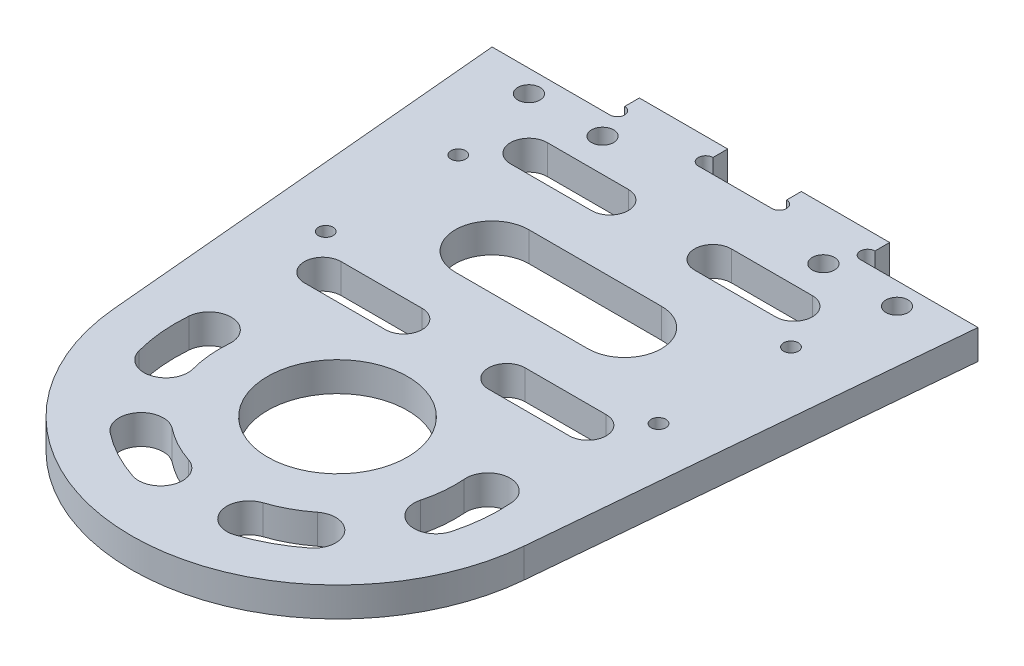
ISO-10303-21;
HEADER;
FILE_DESCRIPTION(('STEP AP214'),'2;1');
FILE_NAME('part.step','',(''),(''),'','','');
FILE_SCHEMA(('AUTOMOTIVE_DESIGN { 1 0 10303 214 1 1 1 1 }'));
ENDSEC;
DATA;
#1=APPLICATION_CONTEXT('core data for automotive mechanical design processes');
#2=APPLICATION_PROTOCOL_DEFINITION('international standard','automotive_design',2000,#1);
#3=PRODUCT_CONTEXT('',#1,'mechanical');
#4=PRODUCT('Part','Part','',(#3));
#5=PRODUCT_RELATED_PRODUCT_CATEGORY('part','',(#4));
#6=PRODUCT_DEFINITION_FORMATION('','',#4);
#7=PRODUCT_DEFINITION_CONTEXT('part definition',#1,'design');
#8=PRODUCT_DEFINITION('design','',#6,#7);
#9=PRODUCT_DEFINITION_SHAPE('','',#8);
#10=(LENGTH_UNIT() NAMED_UNIT(*) SI_UNIT(.MILLI.,.METRE.));
#11=(NAMED_UNIT(*) PLANE_ANGLE_UNIT() SI_UNIT($,.RADIAN.));
#12=(NAMED_UNIT(*) SI_UNIT($,.STERADIAN.) SOLID_ANGLE_UNIT());
#13=UNCERTAINTY_MEASURE_WITH_UNIT(LENGTH_MEASURE(1.E-05),#10,'distance_accuracy_value','');
#14=(GEOMETRIC_REPRESENTATION_CONTEXT(3) GLOBAL_UNCERTAINTY_ASSIGNED_CONTEXT((#13)) GLOBAL_UNIT_ASSIGNED_CONTEXT((#10,
#11,#12)) REPRESENTATION_CONTEXT('',''));
#15=CARTESIAN_POINT('',(0.,0.,0.));
#16=DIRECTION('',(0.,0.,1.));
#17=DIRECTION('',(1.,0.,0.));
#18=AXIS2_PLACEMENT_3D('',#15,#16,#17);
#19=CARTESIAN_POINT('',(0.,4.,0.));
#20=DIRECTION('',(0.,1.,0.));
#21=DIRECTION('',(0.,0.,1.));
#22=AXIS2_PLACEMENT_3D('',#19,#20,#21);
#23=PLANE('',#22);
#24=CARTESIAN_POINT('',(-9.,4.,-30.));
#25=DIRECTION('',(0.,1.,0.));
#26=DIRECTION('',(0.,0.,1.));
#27=AXIS2_PLACEMENT_3D('',#24,#25,#26);
#28=CIRCLE('',#27,5.);
#29=CARTESIAN_POINT('',(-9.,4.,-35.));
#30=VERTEX_POINT('',#29);
#31=CARTESIAN_POINT('',(-9.,4.,-25.));
#32=VERTEX_POINT('',#31);
#33=EDGE_CURVE('E54',#30,#32,#28,.T.);
#34=ORIENTED_EDGE('',*,*,#33,.F.);
#35=DIRECTION('',(-1.,0.,0.));
#36=VECTOR('',#35,1.);
#37=CARTESIAN_POINT('',(-9.,4.,-35.));
#38=LINE('',#37,#36);
#39=CARTESIAN_POINT('',(9.,4.,-35.));
#40=VERTEX_POINT('',#39);
#41=EDGE_CURVE('E385',#40,#30,#38,.T.);
#42=ORIENTED_EDGE('',*,*,#41,.F.);
#43=CARTESIAN_POINT('',(9.,4.,-30.));
#44=DIRECTION('',(0.,1.,0.));
#45=DIRECTION('',(0.,0.,1.));
#46=AXIS2_PLACEMENT_3D('',#43,#44,#45);
#47=CIRCLE('',#46,5.);
#48=CARTESIAN_POINT('',(9.,4.,-25.));
#49=VERTEX_POINT('',#48);
#50=EDGE_CURVE('E388',#49,#40,#47,.T.);
#51=ORIENTED_EDGE('',*,*,#50,.F.);
#52=DIRECTION('',(1.,0.,0.));
#53=VECTOR('',#52,1.);
#54=CARTESIAN_POINT('',(-9.,4.,-25.));
#55=LINE('',#54,#53);
#56=EDGE_CURVE('E394',#32,#49,#55,.T.);
#57=ORIENTED_EDGE('',*,*,#56,.F.);
#58=EDGE_LOOP('',(#34,#42,#51,#57));
#59=FACE_BOUND('',#58,.T.);
#60=CARTESIAN_POINT('',(18.,4.,-16.));
#61=DIRECTION('',(0.,1.,0.));
#62=DIRECTION('',(0.,0.,-1.));
#63=AXIS2_PLACEMENT_3D('',#60,#61,#62);
#64=CIRCLE('',#63,2.5);
#65=CARTESIAN_POINT('',(18.,4.,-13.5));
#66=VERTEX_POINT('',#65);
#67=CARTESIAN_POINT('',(18.,4.,-18.5));
#68=VERTEX_POINT('',#67);
#69=EDGE_CURVE('E510',#66,#68,#64,.T.);
#70=ORIENTED_EDGE('',*,*,#69,.F.);
#71=DIRECTION('',(1.,0.,0.));
#72=VECTOR('',#71,1.);
#73=CARTESIAN_POINT('',(18.,4.,-13.5));
#74=LINE('',#73,#72);
#75=CARTESIAN_POINT('',(7.,4.,-13.5));
#76=VERTEX_POINT('',#75);
#77=EDGE_CURVE('E543',#76,#66,#74,.T.);
#78=ORIENTED_EDGE('',*,*,#77,.F.);
#79=CARTESIAN_POINT('',(7.,4.,-16.));
#80=DIRECTION('',(0.,1.,0.));
#81=DIRECTION('',(0.,0.,-1.));
#82=AXIS2_PLACEMENT_3D('',#79,#80,#81);
#83=CIRCLE('',#82,2.5);
#84=CARTESIAN_POINT('',(7.,4.,-18.5));
#85=VERTEX_POINT('',#84);
#86=EDGE_CURVE('E546',#85,#76,#83,.T.);
#87=ORIENTED_EDGE('',*,*,#86,.F.);
#88=DIRECTION('',(-1.,0.,0.));
#89=VECTOR('',#88,1.);
#90=CARTESIAN_POINT('',(18.,4.,-18.5));
#91=LINE('',#90,#89);
#92=EDGE_CURVE('E550',#68,#85,#91,.T.);
#93=ORIENTED_EDGE('',*,*,#92,.F.);
#94=EDGE_LOOP('',(#70,#78,#87,#93));
#95=FACE_BOUND('',#94,.T.);
#96=CARTESIAN_POINT('',(-18.9406969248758,4.,-1.5));
#97=DIRECTION('',(0.,1.,0.));
#98=DIRECTION('',(0.,0.,1.));
#99=AXIS2_PLACEMENT_3D('',#96,#97,#98);
#100=CIRCLE('',#99,3.);
#101=CARTESIAN_POINT('',(-15.9500605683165,4.,-1.26315789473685));
#102=VERTEX_POINT('',#101);
#103=CARTESIAN_POINT('',(-21.9313332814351,4.,-1.73684210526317));
#104=VERTEX_POINT('',#103);
#105=EDGE_CURVE('E521',#102,#104,#100,.T.);
#106=ORIENTED_EDGE('',*,*,#105,.F.);
#107=CARTESIAN_POINT('',(0.,4.,0.));
#108=DIRECTION('',(0.,-1.,0.));
#109=DIRECTION('',(0.,0.,1.));
#110=AXIS2_PLACEMENT_3D('',#107,#108,#109);
#111=CIRCLE('',#110,16.);
#112=CARTESIAN_POINT('',(-15.4458695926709,4.,4.17433977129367));
#113=VERTEX_POINT('',#112);
#114=EDGE_CURVE('E511',#113,#102,#111,.T.);
#115=ORIENTED_EDGE('',*,*,#114,.F.);
#116=CARTESIAN_POINT('',(-18.3419701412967,4.,4.95702847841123));
#117=DIRECTION('',(0.,1.,0.));
#118=DIRECTION('',(0.,0.,1.));
#119=AXIS2_PLACEMENT_3D('',#116,#117,#118);
#120=CIRCLE('',#119,3.);
#121=CARTESIAN_POINT('',(-21.2380706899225,4.,5.73971718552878));
#122=VERTEX_POINT('',#121);
#123=EDGE_CURVE('E514',#122,#113,#120,.T.);
#124=ORIENTED_EDGE('',*,*,#123,.F.);
#125=CARTESIAN_POINT('',(0.,4.,0.));
#126=DIRECTION('',(0.,1.,0.));
#127=DIRECTION('',(0.,0.,1.));
#128=AXIS2_PLACEMENT_3D('',#125,#126,#127);
#129=CIRCLE('',#128,22.);
#130=EDGE_CURVE('E518',#104,#122,#129,.T.);
#131=ORIENTED_EDGE('',*,*,#130,.F.);
#132=EDGE_LOOP('',(#106,#115,#124,#131));
#133=FACE_BOUND('',#132,.T.);
#134=CARTESIAN_POINT('',(-18.,4.,-44.));
#135=DIRECTION('',(0.,1.,0.));
#136=DIRECTION('',(0.,0.,1.));
#137=AXIS2_PLACEMENT_3D('',#134,#135,#136);
#138=CIRCLE('',#137,2.49999999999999);
#139=CARTESIAN_POINT('',(-18.,4.,-46.5));
#140=VERTEX_POINT('',#139);
#141=CARTESIAN_POINT('',(-18.,4.,-41.5));
#142=VERTEX_POINT('',#141);
#143=EDGE_CURVE('E574',#140,#142,#138,.T.);
#144=ORIENTED_EDGE('',*,*,#143,.F.);
#145=DIRECTION('',(-1.,0.,0.));
#146=VECTOR('',#145,1.);
#147=CARTESIAN_POINT('',(-18.,4.,-46.5));
#148=LINE('',#147,#146);
#149=CARTESIAN_POINT('',(-7.,4.,-46.5));
#150=VERTEX_POINT('',#149);
#151=EDGE_CURVE('E607',#150,#140,#148,.T.);
#152=ORIENTED_EDGE('',*,*,#151,.F.);
#153=CARTESIAN_POINT('',(-7.,4.,-44.));
#154=DIRECTION('',(0.,1.,0.));
#155=DIRECTION('',(0.,0.,1.));
#156=AXIS2_PLACEMENT_3D('',#153,#154,#155);
#157=CIRCLE('',#156,2.49999999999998);
#158=CARTESIAN_POINT('',(-7.,4.,-41.5));
#159=VERTEX_POINT('',#158);
#160=EDGE_CURVE('E610',#159,#150,#157,.T.);
#161=ORIENTED_EDGE('',*,*,#160,.F.);
#162=DIRECTION('',(1.,0.,0.));
#163=VECTOR('',#162,1.);
#164=CARTESIAN_POINT('',(-18.,4.,-41.5));
#165=LINE('',#164,#163);
#166=EDGE_CURVE('E614',#142,#159,#165,.T.);
#167=ORIENTED_EDGE('',*,*,#166,.F.);
#168=EDGE_LOOP('',(#144,#152,#161,#167));
#169=FACE_BOUND('',#168,.T.);
#170=CARTESIAN_POINT('',(-18.,4.,-16.));
#171=DIRECTION('',(0.,1.,0.));
#172=DIRECTION('',(0.,0.,1.));
#173=AXIS2_PLACEMENT_3D('',#170,#171,#172);
#174=CIRCLE('',#173,2.5);
#175=CARTESIAN_POINT('',(-18.,4.,-18.5));
#176=VERTEX_POINT('',#175);
#177=CARTESIAN_POINT('',(-18.,4.,-13.5));
#178=VERTEX_POINT('',#177);
#179=EDGE_CURVE('E585',#176,#178,#174,.T.);
#180=ORIENTED_EDGE('',*,*,#179,.F.);
#181=DIRECTION('',(-1.,0.,0.));
#182=VECTOR('',#181,1.);
#183=CARTESIAN_POINT('',(-18.,4.,-18.5));
#184=LINE('',#183,#182);
#185=CARTESIAN_POINT('',(-7.,4.,-18.5));
#186=VERTEX_POINT('',#185);
#187=EDGE_CURVE('E575',#186,#176,#184,.T.);
#188=ORIENTED_EDGE('',*,*,#187,.F.);
#189=CARTESIAN_POINT('',(-7.,4.,-16.));
#190=DIRECTION('',(0.,1.,0.));
#191=DIRECTION('',(0.,0.,1.));
#192=AXIS2_PLACEMENT_3D('',#189,#190,#191);
#193=CIRCLE('',#192,2.5);
#194=CARTESIAN_POINT('',(-7.,4.,-13.5));
#195=VERTEX_POINT('',#194);
#196=EDGE_CURVE('E578',#195,#186,#193,.T.);
#197=ORIENTED_EDGE('',*,*,#196,.F.);
#198=DIRECTION('',(1.,0.,0.));
#199=VECTOR('',#198,1.);
#200=CARTESIAN_POINT('',(-18.,4.,-13.5));
#201=LINE('',#200,#199);
#202=EDGE_CURVE('E582',#178,#195,#201,.T.);
#203=ORIENTED_EDGE('',*,*,#202,.F.);
#204=EDGE_LOOP('',(#180,#188,#197,#203));
#205=FACE_BOUND('',#204,.T.);
#206=CARTESIAN_POINT('',(18.9406969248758,4.,-1.5));
#207=DIRECTION('',(0.,1.,0.));
#208=DIRECTION('',(0.,0.,-1.));
#209=AXIS2_PLACEMENT_3D('',#206,#207,#208);
#210=CIRCLE('',#209,3.);
#211=CARTESIAN_POINT('',(21.9313332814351,4.,-1.73684210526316));
#212=VERTEX_POINT('',#211);
#213=CARTESIAN_POINT('',(15.9500605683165,4.,-1.26315789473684));
#214=VERTEX_POINT('',#213);
#215=EDGE_CURVE('E423',#212,#214,#210,.T.);
#216=ORIENTED_EDGE('',*,*,#215,.F.);
#217=CARTESIAN_POINT('',(0.,4.,0.));
#218=DIRECTION('',(0.,1.,0.));
#219=DIRECTION('',(0.,0.,-1.));
#220=AXIS2_PLACEMENT_3D('',#217,#218,#219);
#221=CIRCLE('',#220,22.);
#222=CARTESIAN_POINT('',(21.2380706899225,4.,5.73971718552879));
#223=VERTEX_POINT('',#222);
#224=EDGE_CURVE('E413',#223,#212,#221,.T.);
#225=ORIENTED_EDGE('',*,*,#224,.F.);
#226=CARTESIAN_POINT('',(18.3419701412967,4.,4.95702847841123));
#227=DIRECTION('',(0.,1.,0.));
#228=DIRECTION('',(0.,0.,-1.));
#229=AXIS2_PLACEMENT_3D('',#226,#227,#228);
#230=CIRCLE('',#229,3.);
#231=CARTESIAN_POINT('',(15.4458695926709,4.,4.17433977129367));
#232=VERTEX_POINT('',#231);
#233=EDGE_CURVE('E416',#232,#223,#230,.T.);
#234=ORIENTED_EDGE('',*,*,#233,.F.);
#235=CARTESIAN_POINT('',(0.,4.,0.));
#236=DIRECTION('',(0.,-1.,0.));
#237=DIRECTION('',(0.,0.,-1.));
#238=AXIS2_PLACEMENT_3D('',#235,#236,#237);
#239=CIRCLE('',#238,16.);
#240=EDGE_CURVE('E420',#214,#232,#239,.T.);
#241=ORIENTED_EDGE('',*,*,#240,.F.);
#242=EDGE_LOOP('',(#216,#225,#234,#241));
#243=FACE_BOUND('',#242,.T.);
#244=CARTESIAN_POINT('',(11.7131860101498,4.,14.9599890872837));
#245=DIRECTION('',(0.,1.,0.));
#246=DIRECTION('',(0.,0.,-1.));
#247=AXIS2_PLACEMENT_3D('',#244,#245,#246);
#248=CIRCLE('',#247,3.);
#249=CARTESIAN_POINT('',(13.5626364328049,4.,17.3220926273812));
#250=VERTEX_POINT('',#249);
#251=CARTESIAN_POINT('',(9.86373558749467,4.,12.5978855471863));
#252=VERTEX_POINT('',#251);
#253=EDGE_CURVE('E446',#250,#252,#248,.T.);
#254=ORIENTED_EDGE('',*,*,#253,.F.);
#255=CARTESIAN_POINT('',(7.56339435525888E-13,4.,0.));
#256=DIRECTION('',(0.,1.,0.));
#257=DIRECTION('',(0.,0.,-1.));
#258=AXIS2_PLACEMENT_3D('',#255,#256,#257);
#259=CIRCLE('',#258,22.);
#260=CARTESIAN_POINT('',(6.94736842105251,4.,20.8742442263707));
#261=VERTEX_POINT('',#260);
#262=EDGE_CURVE('E479',#261,#250,#259,.T.);
#263=ORIENTED_EDGE('',*,*,#262,.F.);
#264=CARTESIAN_POINT('',(6.,4.,18.0277563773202));
#265=DIRECTION('',(0.,1.,0.));
#266=DIRECTION('',(0.,0.,-1.));
#267=AXIS2_PLACEMENT_3D('',#264,#265,#266);
#268=CIRCLE('',#267,3.);
#269=CARTESIAN_POINT('',(5.05263157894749,4.,15.1812685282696));
#270=VERTEX_POINT('',#269);
#271=EDGE_CURVE('E482',#270,#261,#268,.T.);
#272=ORIENTED_EDGE('',*,*,#271,.F.);
#273=CARTESIAN_POINT('',(7.56339435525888E-13,4.,0.));
#274=DIRECTION('',(0.,-1.,0.));
#275=DIRECTION('',(0.,0.,-1.));
#276=AXIS2_PLACEMENT_3D('',#273,#274,#275);
#277=CIRCLE('',#276,16.);
#278=EDGE_CURVE('E486',#252,#270,#277,.T.);
#279=ORIENTED_EDGE('',*,*,#278,.F.);
#280=EDGE_LOOP('',(#254,#263,#272,#279));
#281=FACE_BOUND('',#280,.T.);
#282=CARTESIAN_POINT('',(18.,4.,-44.));
#283=DIRECTION('',(0.,1.,0.));
#284=DIRECTION('',(0.,0.,-1.));
#285=AXIS2_PLACEMENT_3D('',#282,#283,#284);
#286=CIRCLE('',#285,2.49999999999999);
#287=CARTESIAN_POINT('',(18.,4.,-41.5));
#288=VERTEX_POINT('',#287);
#289=CARTESIAN_POINT('',(18.,4.,-46.5));
#290=VERTEX_POINT('',#289);
#291=EDGE_CURVE('E457',#288,#290,#286,.T.);
#292=ORIENTED_EDGE('',*,*,#291,.F.);
#293=DIRECTION('',(1.,0.,0.));
#294=VECTOR('',#293,1.);
#295=CARTESIAN_POINT('',(18.,4.,-41.5));
#296=LINE('',#295,#294);
#297=CARTESIAN_POINT('',(7.,4.,-41.5));
#298=VERTEX_POINT('',#297);
#299=EDGE_CURVE('E447',#298,#288,#296,.T.);
#300=ORIENTED_EDGE('',*,*,#299,.F.);
#301=CARTESIAN_POINT('',(7.,4.,-44.));
#302=DIRECTION('',(0.,1.,0.));
#303=DIRECTION('',(0.,0.,-1.));
#304=AXIS2_PLACEMENT_3D('',#301,#302,#303);
#305=CIRCLE('',#304,2.49999999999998);
#306=CARTESIAN_POINT('',(7.,4.,-46.5));
#307=VERTEX_POINT('',#306);
#308=EDGE_CURVE('E450',#307,#298,#305,.T.);
#309=ORIENTED_EDGE('',*,*,#308,.F.);
#310=DIRECTION('',(-1.,0.,0.));
#311=VECTOR('',#310,1.);
#312=CARTESIAN_POINT('',(18.,4.,-46.5));
#313=LINE('',#312,#311);
#314=EDGE_CURVE('E454',#290,#307,#313,.T.);
#315=ORIENTED_EDGE('',*,*,#314,.F.);
#316=EDGE_LOOP('',(#292,#300,#309,#315));
#317=FACE_BOUND('',#316,.T.);
#318=CARTESIAN_POINT('',(-11.7131860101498,4.,14.9599890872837));
#319=DIRECTION('',(0.,1.,0.));
#320=DIRECTION('',(0.,0.,1.));
#321=AXIS2_PLACEMENT_3D('',#318,#319,#320);
#322=CIRCLE('',#321,2.99999999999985);
#323=CARTESIAN_POINT('',(-9.86373558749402,4.,12.5978855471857));
#324=VERTEX_POINT('',#323);
#325=CARTESIAN_POINT('',(-13.5626364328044,4.,17.3220926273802));
#326=VERTEX_POINT('',#325);
#327=EDGE_CURVE('E587',#324,#326,#322,.T.);
#328=ORIENTED_EDGE('',*,*,#327,.F.);
#329=CARTESIAN_POINT('',(7.56339435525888E-13,4.,0.));
#330=DIRECTION('',(0.,-1.,0.));
#331=DIRECTION('',(0.,0.,1.));
#332=AXIS2_PLACEMENT_3D('',#329,#330,#331);
#333=CIRCLE('',#332,16.0000000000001);
#334=CARTESIAN_POINT('',(-5.0526315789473,4.,15.1812685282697));
#335=VERTEX_POINT('',#334);
#336=EDGE_CURVE('E632',#335,#324,#333,.T.);
#337=ORIENTED_EDGE('',*,*,#336,.F.);
#338=CARTESIAN_POINT('',(-6.,4.,18.0277563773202));
#339=DIRECTION('',(0.,1.,0.));
#340=DIRECTION('',(0.,0.,1.));
#341=AXIS2_PLACEMENT_3D('',#338,#339,#340);
#342=CIRCLE('',#341,2.99999999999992);
#343=CARTESIAN_POINT('',(-6.94736842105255,4.,20.8742442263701));
#344=VERTEX_POINT('',#343);
#345=EDGE_CURVE('E646',#344,#335,#342,.T.);
#346=ORIENTED_EDGE('',*,*,#345,.F.);
#347=CARTESIAN_POINT('',(7.56339435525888E-13,4.,0.));
#348=DIRECTION('',(0.,1.,0.));
#349=DIRECTION('',(0.,0.,1.));
#350=AXIS2_PLACEMENT_3D('',#347,#348,#349);
#351=CIRCLE('',#350,21.9999999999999);
#352=EDGE_CURVE('E643',#326,#344,#351,.T.);
#353=ORIENTED_EDGE('',*,*,#352,.F.);
#354=EDGE_LOOP('',(#328,#337,#346,#353));
#355=FACE_BOUND('',#354,.T.);
#356=CARTESIAN_POINT('',(-22.6,4.,-39.));
#357=DIRECTION('',(0.,1.,0.));
#358=DIRECTION('',(0.,0.,1.));
#359=AXIS2_PLACEMENT_3D('',#356,#357,#358);
#360=CIRCLE('',#359,1.);
#361=CARTESIAN_POINT('',(-22.6,4.,-38.));
#362=VERTEX_POINT('',#361);
#363=EDGE_CURVE('E684',#362,#362,#360,.T.);
#364=ORIENTED_EDGE('',*,*,#363,.F.);
#365=EDGE_LOOP('',(#364));
#366=FACE_BOUND('',#365,.T.);
#367=CARTESIAN_POINT('',(17.,4.,-55.));
#368=DIRECTION('',(0.,1.,0.));
#369=DIRECTION('',(0.,0.,1.));
#370=AXIS2_PLACEMENT_3D('',#367,#368,#369);
#371=CIRCLE('',#370,1.);
#372=CARTESIAN_POINT('',(17.,4.,-56.));
#373=VERTEX_POINT('',#372);
#374=CARTESIAN_POINT('',(17.,4.,-54.));
#375=VERTEX_POINT('',#374);
#376=EDGE_CURVE('E678',#373,#375,#371,.T.);
#377=ORIENTED_EDGE('',*,*,#376,.F.);
#378=DIRECTION('',(0.,0.,-1.));
#379=VECTOR('',#378,1.);
#380=CARTESIAN_POINT('',(17.,4.,-54.));
#381=LINE('',#380,#379);
#382=CARTESIAN_POINT('',(17.,4.,-58.));
#383=VERTEX_POINT('',#382);
#384=EDGE_CURVE('E751',#373,#383,#381,.T.);
#385=ORIENTED_EDGE('',*,*,#384,.T.);
#386=DIRECTION('',(-1.,0.,0.));
#387=VECTOR('',#386,1.);
#388=CARTESIAN_POINT('',(17.,4.,-58.));
#389=LINE('',#388,#387);
#390=CARTESIAN_POINT('',(5.,4.,-58.));
#391=VERTEX_POINT('',#390);
#392=EDGE_CURVE('E747',#383,#391,#389,.T.);
#393=ORIENTED_EDGE('',*,*,#392,.T.);
#394=DIRECTION('',(0.,0.,1.));
#395=VECTOR('',#394,1.);
#396=CARTESIAN_POINT('',(5.,4.,-54.));
#397=LINE('',#396,#395);
#398=CARTESIAN_POINT('',(5.,4.,-56.));
#399=VERTEX_POINT('',#398);
#400=EDGE_CURVE('E744',#391,#399,#397,.T.);
#401=ORIENTED_EDGE('',*,*,#400,.T.);
#402=CARTESIAN_POINT('',(5.,4.,-55.));
#403=DIRECTION('',(0.,1.,0.));
#404=DIRECTION('',(0.,0.,1.));
#405=AXIS2_PLACEMENT_3D('',#402,#403,#404);
#406=CIRCLE('',#405,1.);
#407=CARTESIAN_POINT('',(5.,4.,-54.));
#408=VERTEX_POINT('',#407);
#409=EDGE_CURVE('E689',#408,#399,#406,.T.);
#410=ORIENTED_EDGE('',*,*,#409,.F.);
#411=DIRECTION('',(1.,0.,0.));
#412=VECTOR('',#411,1.);
#413=CARTESIAN_POINT('',(0.,4.,-54.));
#414=LINE('',#413,#412);
#415=CARTESIAN_POINT('',(-5.,4.,-54.));
#416=VERTEX_POINT('',#415);
#417=EDGE_CURVE('E802',#416,#408,#414,.T.);
#418=ORIENTED_EDGE('',*,*,#417,.F.);
#419=CARTESIAN_POINT('',(-5.,4.,-55.));
#420=DIRECTION('',(0.,1.,0.));
#421=DIRECTION('',(0.,0.,1.));
#422=AXIS2_PLACEMENT_3D('',#419,#420,#421);
#423=CIRCLE('',#422,1.);
#424=CARTESIAN_POINT('',(-5.,4.,-56.));
#425=VERTEX_POINT('',#424);
#426=EDGE_CURVE('E691',#425,#416,#423,.T.);
#427=ORIENTED_EDGE('',*,*,#426,.F.);
#428=DIRECTION('',(0.,0.,-1.));
#429=VECTOR('',#428,1.);
#430=CARTESIAN_POINT('',(-5.,4.,-54.));
#431=LINE('',#430,#429);
#432=CARTESIAN_POINT('',(-5.,4.,-58.));
#433=VERTEX_POINT('',#432);
#434=EDGE_CURVE('E772',#425,#433,#431,.T.);
#435=ORIENTED_EDGE('',*,*,#434,.T.);
#436=DIRECTION('',(-1.,0.,0.));
#437=VECTOR('',#436,1.);
#438=CARTESIAN_POINT('',(-17.,4.,-58.));
#439=LINE('',#438,#437);
#440=CARTESIAN_POINT('',(-17.,4.,-58.));
#441=VERTEX_POINT('',#440);
#442=EDGE_CURVE('E764',#433,#441,#439,.T.);
#443=ORIENTED_EDGE('',*,*,#442,.T.);
#444=DIRECTION('',(0.,0.,1.));
#445=VECTOR('',#444,1.);
#446=CARTESIAN_POINT('',(-17.,4.,-54.));
#447=LINE('',#446,#445);
#448=CARTESIAN_POINT('',(-17.,4.,-56.));
#449=VERTEX_POINT('',#448);
#450=EDGE_CURVE('E753',#441,#449,#447,.T.);
#451=ORIENTED_EDGE('',*,*,#450,.T.);
#452=CARTESIAN_POINT('',(-17.,4.,-55.));
#453=DIRECTION('',(0.,1.,0.));
#454=DIRECTION('',(0.,0.,1.));
#455=AXIS2_PLACEMENT_3D('',#452,#453,#454);
#456=CIRCLE('',#455,1.);
#457=CARTESIAN_POINT('',(-17.,4.,-54.));
#458=VERTEX_POINT('',#457);
#459=EDGE_CURVE('E695',#458,#449,#456,.T.);
#460=ORIENTED_EDGE('',*,*,#459,.F.);
#461=CARTESIAN_POINT('',(-33.,4.,-54.));
#462=VERTEX_POINT('',#461);
#463=EDGE_CURVE('E799',#462,#458,#414,.T.);
#464=ORIENTED_EDGE('',*,*,#463,.F.);
#465=DIRECTION('',(0.0901066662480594,0.,0.995932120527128));
#466=VECTOR('',#465,1.);
#467=CARTESIAN_POINT('',(-27.8860993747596,4.,2.52298665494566));
#468=LINE('',#467,#466);
#469=CARTESIAN_POINT('',(-27.8860993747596,4.,2.52298665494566));
#470=VERTEX_POINT('',#469);
#471=EDGE_CURVE('E789',#462,#470,#468,.T.);
#472=ORIENTED_EDGE('',*,*,#471,.T.);
#473=CARTESIAN_POINT('',(0.,4.,0.));
#474=DIRECTION('',(0.,1.,0.));
#475=DIRECTION('',(0.,0.,1.));
#476=AXIS2_PLACEMENT_3D('',#473,#474,#475);
#477=CIRCLE('',#476,28.);
#478=CARTESIAN_POINT('',(27.8860993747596,4.,2.52298665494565));
#479=VERTEX_POINT('',#478);
#480=EDGE_CURVE('E815',#470,#479,#477,.T.);
#481=ORIENTED_EDGE('',*,*,#480,.T.);
#482=DIRECTION('',(-0.090106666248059,0.,0.995932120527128));
#483=VECTOR('',#482,1.);
#484=CARTESIAN_POINT('',(27.8860993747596,4.,2.52298665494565));
#485=LINE('',#484,#483);
#486=CARTESIAN_POINT('',(33.,4.,-54.));
#487=VERTEX_POINT('',#486);
#488=EDGE_CURVE('E778',#487,#479,#485,.T.);
#489=ORIENTED_EDGE('',*,*,#488,.F.);
#490=EDGE_CURVE('E798',#375,#487,#414,.T.);
#491=ORIENTED_EDGE('',*,*,#490,.F.);
#492=EDGE_LOOP('',(#377,#385,#393,#401,#410,#418,#427,#435,#443,#451,#460,#464,#472,#481,#489,#491));
#493=FACE_BOUND('',#492,.T.);
#494=CARTESIAN_POINT('',(22.6,4.,-21.));
#495=DIRECTION('',(0.,1.,0.));
#496=DIRECTION('',(0.,0.,1.));
#497=AXIS2_PLACEMENT_3D('',#494,#495,#496);
#498=CIRCLE('',#497,1.);
#499=CARTESIAN_POINT('',(22.6,4.,-20.));
#500=VERTEX_POINT('',#499);
#501=EDGE_CURVE('E660',#500,#500,#498,.T.);
#502=ORIENTED_EDGE('',*,*,#501,.F.);
#503=EDGE_LOOP('',(#502));
#504=FACE_BOUND('',#503,.T.);
#505=CARTESIAN_POINT('',(22.6,4.,-39.));
#506=DIRECTION('',(0.,1.,0.));
#507=DIRECTION('',(0.,0.,1.));
#508=AXIS2_PLACEMENT_3D('',#505,#506,#507);
#509=CIRCLE('',#508,1.);
#510=CARTESIAN_POINT('',(22.6,4.,-38.));
#511=VERTEX_POINT('',#510);
#512=EDGE_CURVE('E673',#511,#511,#509,.T.);
#513=ORIENTED_EDGE('',*,*,#512,.F.);
#514=EDGE_LOOP('',(#513));
#515=FACE_BOUND('',#514,.T.);
#516=CARTESIAN_POINT('',(-22.6,4.,-21.));
#517=DIRECTION('',(0.,1.,0.));
#518=DIRECTION('',(0.,0.,1.));
#519=AXIS2_PLACEMENT_3D('',#516,#517,#518);
#520=CIRCLE('',#519,1.);
#521=CARTESIAN_POINT('',(-22.6,4.,-20.));
#522=VERTEX_POINT('',#521);
#523=EDGE_CURVE('E666',#522,#522,#520,.T.);
#524=ORIENTED_EDGE('',*,*,#523,.F.);
#525=EDGE_LOOP('',(#524));
#526=FACE_BOUND('',#525,.T.);
#527=CARTESIAN_POINT('',(7.56339435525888E-13,4.,0.));
#528=DIRECTION('',(0.,1.,0.));
#529=DIRECTION('',(0.,0.,1.));
#530=AXIS2_PLACEMENT_3D('',#527,#528,#529);
#531=CIRCLE('',#530,9.5);
#532=CARTESIAN_POINT('',(7.56339435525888E-13,4.,9.49999999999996));
#533=VERTEX_POINT('',#532);
#534=EDGE_CURVE('E702',#533,#533,#531,.T.);
#535=ORIENTED_EDGE('',*,*,#534,.F.);
#536=EDGE_LOOP('',(#535));
#537=FACE_BOUND('',#536,.T.);
#538=CARTESIAN_POINT('',(-25.,4.,-51.));
#539=DIRECTION('',(0.,1.,0.));
#540=DIRECTION('',(0.,0.,1.));
#541=AXIS2_PLACEMENT_3D('',#538,#539,#540);
#542=CIRCLE('',#541,1.5);
#543=CARTESIAN_POINT('',(-25.,4.,-49.5));
#544=VERTEX_POINT('',#543);
#545=EDGE_CURVE('E714',#544,#544,#542,.T.);
#546=ORIENTED_EDGE('',*,*,#545,.F.);
#547=EDGE_LOOP('',(#546));
#548=FACE_BOUND('',#547,.T.);
#549=CARTESIAN_POINT('',(15.,4.,-51.));
#550=DIRECTION('',(0.,1.,0.));
#551=DIRECTION('',(0.,0.,1.));
#552=AXIS2_PLACEMENT_3D('',#549,#550,#551);
#553=CIRCLE('',#552,1.5);
#554=CARTESIAN_POINT('',(15.,4.,-49.5));
#555=VERTEX_POINT('',#554);
#556=EDGE_CURVE('E718',#555,#555,#553,.T.);
#557=ORIENTED_EDGE('',*,*,#556,.F.);
#558=EDGE_LOOP('',(#557));
#559=FACE_BOUND('',#558,.T.);
#560=CARTESIAN_POINT('',(25.,4.,-51.));
#561=DIRECTION('',(0.,1.,0.));
#562=DIRECTION('',(0.,0.,1.));
#563=AXIS2_PLACEMENT_3D('',#560,#561,#562);
#564=CIRCLE('',#563,1.5);
#565=CARTESIAN_POINT('',(25.,4.,-49.5));
#566=VERTEX_POINT('',#565);
#567=EDGE_CURVE('E729',#566,#566,#564,.T.);
#568=ORIENTED_EDGE('',*,*,#567,.F.);
#569=EDGE_LOOP('',(#568));
#570=FACE_BOUND('',#569,.T.);
#571=CARTESIAN_POINT('',(-15.,4.,-51.));
#572=DIRECTION('',(0.,1.,0.));
#573=DIRECTION('',(0.,0.,1.));
#574=AXIS2_PLACEMENT_3D('',#571,#572,#573);
#575=CIRCLE('',#574,1.5);
#576=CARTESIAN_POINT('',(-15.,4.,-49.5));
#577=VERTEX_POINT('',#576);
#578=EDGE_CURVE('E717',#577,#577,#575,.T.);
#579=ORIENTED_EDGE('',*,*,#578,.F.);
#580=EDGE_LOOP('',(#579));
#581=FACE_BOUND('',#580,.T.);
#582=ADVANCED_FACE('F39',(#59,#95,#133,#169,#205,#243,#281,#317,#355,#366,#493,#504,#515,#526,
#537,#548,#559,#570,#581),#23,.T.);
#583=CARTESIAN_POINT('',(0.,0.,0.));
#584=DIRECTION('',(0.,1.,0.));
#585=DIRECTION('',(0.,0.,1.));
#586=AXIS2_PLACEMENT_3D('',#583,#584,#585);
#587=PLANE('',#586);
#588=DIRECTION('',(-1.,0.,0.));
#589=VECTOR('',#588,1.);
#590=CARTESIAN_POINT('',(-9.,0.,-35.));
#591=LINE('',#590,#589);
#592=CARTESIAN_POINT('',(9.,0.,-35.));
#593=VERTEX_POINT('',#592);
#594=CARTESIAN_POINT('',(-9.,0.,-35.));
#595=VERTEX_POINT('',#594);
#596=EDGE_CURVE('E375',#593,#595,#591,.T.);
#597=ORIENTED_EDGE('',*,*,#596,.T.);
#598=CARTESIAN_POINT('',(-9.,0.,-30.));
#599=DIRECTION('',(0.,1.,0.));
#600=DIRECTION('',(0.,0.,1.));
#601=AXIS2_PLACEMENT_3D('',#598,#599,#600);
#602=CIRCLE('',#601,5.);
#603=CARTESIAN_POINT('',(-9.,0.,-25.));
#604=VERTEX_POINT('',#603);
#605=EDGE_CURVE('E369',#595,#604,#602,.T.);
#606=ORIENTED_EDGE('',*,*,#605,.T.);
#607=DIRECTION('',(1.,0.,0.));
#608=VECTOR('',#607,1.);
#609=CARTESIAN_POINT('',(-9.,0.,-25.));
#610=LINE('',#609,#608);
#611=CARTESIAN_POINT('',(9.,0.,-25.));
#612=VERTEX_POINT('',#611);
#613=EDGE_CURVE('E378',#604,#612,#610,.T.);
#614=ORIENTED_EDGE('',*,*,#613,.T.);
#615=CARTESIAN_POINT('',(9.,0.,-30.));
#616=DIRECTION('',(0.,1.,0.));
#617=DIRECTION('',(0.,0.,1.));
#618=AXIS2_PLACEMENT_3D('',#615,#616,#617);
#619=CIRCLE('',#618,5.);
#620=EDGE_CURVE('E62',#612,#593,#619,.T.);
#621=ORIENTED_EDGE('',*,*,#620,.T.);
#622=EDGE_LOOP('',(#597,#606,#614,#621));
#623=FACE_BOUND('',#622,.T.);
#624=DIRECTION('',(1.,0.,0.));
#625=VECTOR('',#624,1.);
#626=CARTESIAN_POINT('',(18.,0.,-13.5));
#627=LINE('',#626,#625);
#628=CARTESIAN_POINT('',(7.,0.,-13.5));
#629=VERTEX_POINT('',#628);
#630=CARTESIAN_POINT('',(18.,0.,-13.5));
#631=VERTEX_POINT('',#630);
#632=EDGE_CURVE('E537',#629,#631,#627,.T.);
#633=ORIENTED_EDGE('',*,*,#632,.T.);
#634=CARTESIAN_POINT('',(18.,0.,-16.));
#635=DIRECTION('',(0.,1.,0.));
#636=DIRECTION('',(0.,0.,-1.));
#637=AXIS2_PLACEMENT_3D('',#634,#635,#636);
#638=CIRCLE('',#637,2.5);
#639=CARTESIAN_POINT('',(18.,0.,-18.5));
#640=VERTEX_POINT('',#639);
#641=EDGE_CURVE('E547',#631,#640,#638,.T.);
#642=ORIENTED_EDGE('',*,*,#641,.T.);
#643=DIRECTION('',(-1.,0.,0.));
#644=VECTOR('',#643,1.);
#645=CARTESIAN_POINT('',(18.,0.,-18.5));
#646=LINE('',#645,#644);
#647=CARTESIAN_POINT('',(7.,0.,-18.5));
#648=VERTEX_POINT('',#647);
#649=EDGE_CURVE('E559',#640,#648,#646,.T.);
#650=ORIENTED_EDGE('',*,*,#649,.T.);
#651=CARTESIAN_POINT('',(7.,0.,-16.));
#652=DIRECTION('',(0.,1.,0.));
#653=DIRECTION('',(0.,0.,-1.));
#654=AXIS2_PLACEMENT_3D('',#651,#652,#653);
#655=CIRCLE('',#654,2.5);
#656=EDGE_CURVE('E556',#648,#629,#655,.T.);
#657=ORIENTED_EDGE('',*,*,#656,.T.);
#658=EDGE_LOOP('',(#633,#642,#650,#657));
#659=FACE_BOUND('',#658,.T.);
#660=CARTESIAN_POINT('',(0.,0.,0.));
#661=DIRECTION('',(0.,-1.,0.));
#662=DIRECTION('',(0.,0.,1.));
#663=AXIS2_PLACEMENT_3D('',#660,#661,#662);
#664=CIRCLE('',#663,16.);
#665=CARTESIAN_POINT('',(-15.4458695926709,0.,4.17433977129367));
#666=VERTEX_POINT('',#665);
#667=CARTESIAN_POINT('',(-15.9500605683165,0.,-1.26315789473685));
#668=VERTEX_POINT('',#667);
#669=EDGE_CURVE('E503',#666,#668,#664,.T.);
#670=ORIENTED_EDGE('',*,*,#669,.T.);
#671=CARTESIAN_POINT('',(-18.9406969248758,0.,-1.5));
#672=DIRECTION('',(0.,1.,0.));
#673=DIRECTION('',(0.,0.,1.));
#674=AXIS2_PLACEMENT_3D('',#671,#672,#673);
#675=CIRCLE('',#674,3.);
#676=CARTESIAN_POINT('',(-21.9313332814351,0.,-1.73684210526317));
#677=VERTEX_POINT('',#676);
#678=EDGE_CURVE('E515',#668,#677,#675,.T.);
#679=ORIENTED_EDGE('',*,*,#678,.T.);
#680=CARTESIAN_POINT('',(0.,0.,0.));
#681=DIRECTION('',(0.,1.,0.));
#682=DIRECTION('',(0.,0.,1.));
#683=AXIS2_PLACEMENT_3D('',#680,#681,#682);
#684=CIRCLE('',#683,22.);
#685=CARTESIAN_POINT('',(-21.2380706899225,0.,5.73971718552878));
#686=VERTEX_POINT('',#685);
#687=EDGE_CURVE('E529',#677,#686,#684,.T.);
#688=ORIENTED_EDGE('',*,*,#687,.T.);
#689=CARTESIAN_POINT('',(-18.3419701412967,0.,4.95702847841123));
#690=DIRECTION('',(0.,1.,0.));
#691=DIRECTION('',(0.,0.,1.));
#692=AXIS2_PLACEMENT_3D('',#689,#690,#691);
#693=CIRCLE('',#692,3.);
#694=EDGE_CURVE('E526',#686,#666,#693,.T.);
#695=ORIENTED_EDGE('',*,*,#694,.T.);
#696=EDGE_LOOP('',(#670,#679,#688,#695));
#697=FACE_BOUND('',#696,.T.);
#698=DIRECTION('',(-1.,0.,0.));
#699=VECTOR('',#698,1.);
#700=CARTESIAN_POINT('',(-18.,0.,-46.5));
#701=LINE('',#700,#699);
#702=CARTESIAN_POINT('',(-7.,0.,-46.5));
#703=VERTEX_POINT('',#702);
#704=CARTESIAN_POINT('',(-18.,0.,-46.5));
#705=VERTEX_POINT('',#704);
#706=EDGE_CURVE('E601',#703,#705,#701,.T.);
#707=ORIENTED_EDGE('',*,*,#706,.T.);
#708=CARTESIAN_POINT('',(-18.,0.,-44.));
#709=DIRECTION('',(0.,1.,0.));
#710=DIRECTION('',(0.,0.,1.));
#711=AXIS2_PLACEMENT_3D('',#708,#709,#710);
#712=CIRCLE('',#711,2.49999999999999);
#713=CARTESIAN_POINT('',(-18.,0.,-41.5));
#714=VERTEX_POINT('',#713);
#715=EDGE_CURVE('E611',#705,#714,#712,.T.);
#716=ORIENTED_EDGE('',*,*,#715,.T.);
#717=DIRECTION('',(1.,0.,0.));
#718=VECTOR('',#717,1.);
#719=CARTESIAN_POINT('',(-18.,0.,-41.5));
#720=LINE('',#719,#718);
#721=CARTESIAN_POINT('',(-7.,0.,-41.5));
#722=VERTEX_POINT('',#721);
#723=EDGE_CURVE('E623',#714,#722,#720,.T.);
#724=ORIENTED_EDGE('',*,*,#723,.T.);
#725=CARTESIAN_POINT('',(-7.,0.,-44.));
#726=DIRECTION('',(0.,1.,0.));
#727=DIRECTION('',(0.,0.,1.));
#728=AXIS2_PLACEMENT_3D('',#725,#726,#727);
#729=CIRCLE('',#728,2.49999999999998);
#730=EDGE_CURVE('E620',#722,#703,#729,.T.);
#731=ORIENTED_EDGE('',*,*,#730,.T.);
#732=EDGE_LOOP('',(#707,#716,#724,#731));
#733=FACE_BOUND('',#732,.T.);
#734=DIRECTION('',(-1.,0.,0.));
#735=VECTOR('',#734,1.);
#736=CARTESIAN_POINT('',(-18.,0.,-18.5));
#737=LINE('',#736,#735);
#738=CARTESIAN_POINT('',(-7.,0.,-18.5));
#739=VERTEX_POINT('',#738);
#740=CARTESIAN_POINT('',(-18.,0.,-18.5));
#741=VERTEX_POINT('',#740);
#742=EDGE_CURVE('E567',#739,#741,#737,.T.);
#743=ORIENTED_EDGE('',*,*,#742,.T.);
#744=CARTESIAN_POINT('',(-18.,0.,-16.));
#745=DIRECTION('',(0.,1.,0.));
#746=DIRECTION('',(0.,0.,1.));
#747=AXIS2_PLACEMENT_3D('',#744,#745,#746);
#748=CIRCLE('',#747,2.5);
#749=CARTESIAN_POINT('',(-18.,0.,-13.5));
#750=VERTEX_POINT('',#749);
#751=EDGE_CURVE('E579',#741,#750,#748,.T.);
#752=ORIENTED_EDGE('',*,*,#751,.T.);
#753=DIRECTION('',(1.,0.,0.));
#754=VECTOR('',#753,1.);
#755=CARTESIAN_POINT('',(-18.,0.,-13.5));
#756=LINE('',#755,#754);
#757=CARTESIAN_POINT('',(-7.,0.,-13.5));
#758=VERTEX_POINT('',#757);
#759=EDGE_CURVE('E593',#750,#758,#756,.T.);
#760=ORIENTED_EDGE('',*,*,#759,.T.);
#761=CARTESIAN_POINT('',(-7.,0.,-16.));
#762=DIRECTION('',(0.,1.,0.));
#763=DIRECTION('',(0.,0.,1.));
#764=AXIS2_PLACEMENT_3D('',#761,#762,#763);
#765=CIRCLE('',#764,2.5);
#766=EDGE_CURVE('E590',#758,#739,#765,.T.);
#767=ORIENTED_EDGE('',*,*,#766,.T.);
#768=EDGE_LOOP('',(#743,#752,#760,#767));
#769=FACE_BOUND('',#768,.T.);
#770=CARTESIAN_POINT('',(0.,0.,0.));
#771=DIRECTION('',(0.,1.,0.));
#772=DIRECTION('',(0.,0.,-1.));
#773=AXIS2_PLACEMENT_3D('',#770,#771,#772);
#774=CIRCLE('',#773,22.);
#775=CARTESIAN_POINT('',(21.2380706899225,0.,5.73971718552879));
#776=VERTEX_POINT('',#775);
#777=CARTESIAN_POINT('',(21.9313332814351,0.,-1.73684210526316));
#778=VERTEX_POINT('',#777);
#779=EDGE_CURVE('E407',#776,#778,#774,.T.);
#780=ORIENTED_EDGE('',*,*,#779,.T.);
#781=CARTESIAN_POINT('',(18.9406969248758,0.,-1.5));
#782=DIRECTION('',(0.,1.,0.));
#783=DIRECTION('',(0.,0.,-1.));
#784=AXIS2_PLACEMENT_3D('',#781,#782,#783);
#785=CIRCLE('',#784,3.);
#786=CARTESIAN_POINT('',(15.9500605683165,0.,-1.26315789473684));
#787=VERTEX_POINT('',#786);
#788=EDGE_CURVE('E417',#778,#787,#785,.T.);
#789=ORIENTED_EDGE('',*,*,#788,.T.);
#790=CARTESIAN_POINT('',(0.,0.,0.));
#791=DIRECTION('',(0.,-1.,0.));
#792=DIRECTION('',(0.,0.,-1.));
#793=AXIS2_PLACEMENT_3D('',#790,#791,#792);
#794=CIRCLE('',#793,16.);
#795=CARTESIAN_POINT('',(15.4458695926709,0.,4.17433977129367));
#796=VERTEX_POINT('',#795);
#797=EDGE_CURVE('E431',#787,#796,#794,.T.);
#798=ORIENTED_EDGE('',*,*,#797,.T.);
#799=CARTESIAN_POINT('',(18.3419701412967,0.,4.95702847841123));
#800=DIRECTION('',(0.,1.,0.));
#801=DIRECTION('',(0.,0.,-1.));
#802=AXIS2_PLACEMENT_3D('',#799,#800,#801);
#803=CIRCLE('',#802,3.);
#804=EDGE_CURVE('E428',#796,#776,#803,.T.);
#805=ORIENTED_EDGE('',*,*,#804,.T.);
#806=EDGE_LOOP('',(#780,#789,#798,#805));
#807=FACE_BOUND('',#806,.T.);
#808=CARTESIAN_POINT('',(7.56339435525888E-13,0.,0.));
#809=DIRECTION('',(0.,1.,0.));
#810=DIRECTION('',(0.,0.,-1.));
#811=AXIS2_PLACEMENT_3D('',#808,#809,#810);
#812=CIRCLE('',#811,22.);
#813=CARTESIAN_POINT('',(6.94736842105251,0.,20.8742442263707));
#814=VERTEX_POINT('',#813);
#815=CARTESIAN_POINT('',(13.5626364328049,0.,17.3220926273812));
#816=VERTEX_POINT('',#815);
#817=EDGE_CURVE('E473',#814,#816,#812,.T.);
#818=ORIENTED_EDGE('',*,*,#817,.T.);
#819=CARTESIAN_POINT('',(11.7131860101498,0.,14.9599890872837));
#820=DIRECTION('',(0.,1.,0.));
#821=DIRECTION('',(0.,0.,-1.));
#822=AXIS2_PLACEMENT_3D('',#819,#820,#821);
#823=CIRCLE('',#822,3.);
#824=CARTESIAN_POINT('',(9.86373558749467,0.,12.5978855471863));
#825=VERTEX_POINT('',#824);
#826=EDGE_CURVE('E483',#816,#825,#823,.T.);
#827=ORIENTED_EDGE('',*,*,#826,.T.);
#828=CARTESIAN_POINT('',(7.56339435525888E-13,0.,0.));
#829=DIRECTION('',(0.,-1.,0.));
#830=DIRECTION('',(0.,0.,-1.));
#831=AXIS2_PLACEMENT_3D('',#828,#829,#830);
#832=CIRCLE('',#831,16.);
#833=CARTESIAN_POINT('',(5.05263157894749,0.,15.1812685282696));
#834=VERTEX_POINT('',#833);
#835=EDGE_CURVE('E495',#825,#834,#832,.T.);
#836=ORIENTED_EDGE('',*,*,#835,.T.);
#837=CARTESIAN_POINT('',(6.,0.,18.0277563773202));
#838=DIRECTION('',(0.,1.,0.));
#839=DIRECTION('',(0.,0.,-1.));
#840=AXIS2_PLACEMENT_3D('',#837,#838,#839);
#841=CIRCLE('',#840,3.);
#842=EDGE_CURVE('E492',#834,#814,#841,.T.);
#843=ORIENTED_EDGE('',*,*,#842,.T.);
#844=EDGE_LOOP('',(#818,#827,#836,#843));
#845=FACE_BOUND('',#844,.T.);
#846=DIRECTION('',(1.,0.,0.));
#847=VECTOR('',#846,1.);
#848=CARTESIAN_POINT('',(18.,0.,-41.5));
#849=LINE('',#848,#847);
#850=CARTESIAN_POINT('',(7.,0.,-41.5));
#851=VERTEX_POINT('',#850);
#852=CARTESIAN_POINT('',(18.,0.,-41.5));
#853=VERTEX_POINT('',#852);
#854=EDGE_CURVE('E439',#851,#853,#849,.T.);
#855=ORIENTED_EDGE('',*,*,#854,.T.);
#856=CARTESIAN_POINT('',(18.,0.,-44.));
#857=DIRECTION('',(0.,1.,0.));
#858=DIRECTION('',(0.,0.,-1.));
#859=AXIS2_PLACEMENT_3D('',#856,#857,#858);
#860=CIRCLE('',#859,2.49999999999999);
#861=CARTESIAN_POINT('',(18.,0.,-46.5));
#862=VERTEX_POINT('',#861);
#863=EDGE_CURVE('E451',#853,#862,#860,.T.);
#864=ORIENTED_EDGE('',*,*,#863,.T.);
#865=DIRECTION('',(-1.,0.,0.));
#866=VECTOR('',#865,1.);
#867=CARTESIAN_POINT('',(18.,0.,-46.5));
#868=LINE('',#867,#866);
#869=CARTESIAN_POINT('',(7.,0.,-46.5));
#870=VERTEX_POINT('',#869);
#871=EDGE_CURVE('E465',#862,#870,#868,.T.);
#872=ORIENTED_EDGE('',*,*,#871,.T.);
#873=CARTESIAN_POINT('',(7.,0.,-44.));
#874=DIRECTION('',(0.,1.,0.));
#875=DIRECTION('',(0.,0.,-1.));
#876=AXIS2_PLACEMENT_3D('',#873,#874,#875);
#877=CIRCLE('',#876,2.49999999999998);
#878=EDGE_CURVE('E462',#870,#851,#877,.T.);
#879=ORIENTED_EDGE('',*,*,#878,.T.);
#880=EDGE_LOOP('',(#855,#864,#872,#879));
#881=FACE_BOUND('',#880,.T.);
#882=CARTESIAN_POINT('',(7.56339435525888E-13,0.,0.));
#883=DIRECTION('',(0.,-1.,0.));
#884=DIRECTION('',(0.,0.,1.));
#885=AXIS2_PLACEMENT_3D('',#882,#883,#884);
#886=CIRCLE('',#885,16.0000000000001);
#887=CARTESIAN_POINT('',(-5.0526315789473,0.,15.1812685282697));
#888=VERTEX_POINT('',#887);
#889=CARTESIAN_POINT('',(-9.86373558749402,0.,12.5978855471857));
#890=VERTEX_POINT('',#889);
#891=EDGE_CURVE('E638',#888,#890,#886,.T.);
#892=ORIENTED_EDGE('',*,*,#891,.T.);
#893=CARTESIAN_POINT('',(-11.7131860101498,0.,14.9599890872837));
#894=DIRECTION('',(0.,1.,0.));
#895=DIRECTION('',(0.,0.,1.));
#896=AXIS2_PLACEMENT_3D('',#893,#894,#895);
#897=CIRCLE('',#896,2.99999999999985);
#898=CARTESIAN_POINT('',(-13.5626364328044,0.,17.3220926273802));
#899=VERTEX_POINT('',#898);
#900=EDGE_CURVE('E628',#890,#899,#897,.T.);
#901=ORIENTED_EDGE('',*,*,#900,.T.);
#902=CARTESIAN_POINT('',(7.56339435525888E-13,0.,0.));
#903=DIRECTION('',(0.,1.,0.));
#904=DIRECTION('',(0.,0.,1.));
#905=AXIS2_PLACEMENT_3D('',#902,#903,#904);
#906=CIRCLE('',#905,21.9999999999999);
#907=CARTESIAN_POINT('',(-6.94736842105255,0.,20.8742442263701));
#908=VERTEX_POINT('',#907);
#909=EDGE_CURVE('E631',#899,#908,#906,.T.);
#910=ORIENTED_EDGE('',*,*,#909,.T.);
#911=CARTESIAN_POINT('',(-6.,0.,18.0277563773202));
#912=DIRECTION('',(0.,1.,0.));
#913=DIRECTION('',(0.,0.,1.));
#914=AXIS2_PLACEMENT_3D('',#911,#912,#913);
#915=CIRCLE('',#914,2.99999999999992);
#916=EDGE_CURVE('E635',#908,#888,#915,.T.);
#917=ORIENTED_EDGE('',*,*,#916,.T.);
#918=EDGE_LOOP('',(#892,#901,#910,#917));
#919=FACE_BOUND('',#918,.T.);
#920=CARTESIAN_POINT('',(-22.6,0.,-39.));
#921=DIRECTION('',(0.,1.,0.));
#922=DIRECTION('',(0.,0.,1.));
#923=AXIS2_PLACEMENT_3D('',#920,#921,#922);
#924=CIRCLE('',#923,1.);
#925=CARTESIAN_POINT('',(-22.6,0.,-38.));
#926=VERTEX_POINT('',#925);
#927=EDGE_CURVE('E669',#926,#926,#924,.T.);
#928=ORIENTED_EDGE('',*,*,#927,.T.);
#929=EDGE_LOOP('',(#928));
#930=FACE_BOUND('',#929,.T.);
#931=CARTESIAN_POINT('',(22.6,0.,-21.));
#932=DIRECTION('',(0.,1.,0.));
#933=DIRECTION('',(0.,0.,1.));
#934=AXIS2_PLACEMENT_3D('',#931,#932,#933);
#935=CIRCLE('',#934,1.);
#936=CARTESIAN_POINT('',(22.6,0.,-20.));
#937=VERTEX_POINT('',#936);
#938=EDGE_CURVE('E653',#937,#937,#935,.T.);
#939=ORIENTED_EDGE('',*,*,#938,.T.);
#940=EDGE_LOOP('',(#939));
#941=FACE_BOUND('',#940,.T.);
#942=CARTESIAN_POINT('',(22.6,0.,-39.));
#943=DIRECTION('',(0.,1.,0.));
#944=DIRECTION('',(0.,0.,1.));
#945=AXIS2_PLACEMENT_3D('',#942,#943,#944);
#946=CIRCLE('',#945,1.);
#947=CARTESIAN_POINT('',(22.6,0.,-38.));
#948=VERTEX_POINT('',#947);
#949=EDGE_CURVE('E663',#948,#948,#946,.T.);
#950=ORIENTED_EDGE('',*,*,#949,.T.);
#951=EDGE_LOOP('',(#950));
#952=FACE_BOUND('',#951,.T.);
#953=CARTESIAN_POINT('',(-22.6,0.,-21.));
#954=DIRECTION('',(0.,1.,0.));
#955=DIRECTION('',(0.,0.,1.));
#956=AXIS2_PLACEMENT_3D('',#953,#954,#955);
#957=CIRCLE('',#956,1.);
#958=CARTESIAN_POINT('',(-22.6,0.,-20.));
#959=VERTEX_POINT('',#958);
#960=EDGE_CURVE('E670',#959,#959,#957,.T.);
#961=ORIENTED_EDGE('',*,*,#960,.T.);
#962=EDGE_LOOP('',(#961));
#963=FACE_BOUND('',#962,.T.);
#964=CARTESIAN_POINT('',(7.56339435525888E-13,0.,0.));
#965=DIRECTION('',(0.,1.,0.));
#966=DIRECTION('',(0.,0.,1.));
#967=AXIS2_PLACEMENT_3D('',#964,#965,#966);
#968=CIRCLE('',#967,9.5);
#969=CARTESIAN_POINT('',(7.56339435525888E-13,0.,9.49999999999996));
#970=VERTEX_POINT('',#969);
#971=EDGE_CURVE('E704',#970,#970,#968,.T.);
#972=ORIENTED_EDGE('',*,*,#971,.T.);
#973=EDGE_LOOP('',(#972));
#974=FACE_BOUND('',#973,.T.);
#975=DIRECTION('',(0.,0.,-1.));
#976=VECTOR('',#975,1.);
#977=CARTESIAN_POINT('',(17.,0.,-54.));
#978=LINE('',#977,#976);
#979=CARTESIAN_POINT('',(17.,0.,-56.));
#980=VERTEX_POINT('',#979);
#981=CARTESIAN_POINT('',(17.,0.,-58.));
#982=VERTEX_POINT('',#981);
#983=EDGE_CURVE('E748',#980,#982,#978,.T.);
#984=ORIENTED_EDGE('',*,*,#983,.F.);
#985=CARTESIAN_POINT('',(17.,0.,-55.));
#986=DIRECTION('',(0.,1.,0.));
#987=DIRECTION('',(0.,0.,1.));
#988=AXIS2_PLACEMENT_3D('',#985,#986,#987);
#989=CIRCLE('',#988,1.);
#990=CARTESIAN_POINT('',(17.,0.,-54.));
#991=VERTEX_POINT('',#990);
#992=EDGE_CURVE('E681',#980,#991,#989,.T.);
#993=ORIENTED_EDGE('',*,*,#992,.T.);
#994=DIRECTION('',(1.,0.,0.));
#995=VECTOR('',#994,1.);
#996=CARTESIAN_POINT('',(0.,0.,-54.));
#997=LINE('',#996,#995);
#998=CARTESIAN_POINT('',(33.,0.,-54.));
#999=VERTEX_POINT('',#998);
#1000=EDGE_CURVE('E788',#991,#999,#997,.T.);
#1001=ORIENTED_EDGE('',*,*,#1000,.T.);
#1002=DIRECTION('',(-0.090106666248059,0.,0.995932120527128));
#1003=VECTOR('',#1002,1.);
#1004=CARTESIAN_POINT('',(27.8860993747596,0.,2.52298665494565));
#1005=LINE('',#1004,#1003);
#1006=CARTESIAN_POINT('',(27.8860993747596,0.,2.52298665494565));
#1007=VERTEX_POINT('',#1006);
#1008=EDGE_CURVE('E786',#999,#1007,#1005,.T.);
#1009=ORIENTED_EDGE('',*,*,#1008,.T.);
#1010=CARTESIAN_POINT('',(0.,0.,0.));
#1011=DIRECTION('',(0.,1.,0.));
#1012=DIRECTION('',(0.,0.,1.));
#1013=AXIS2_PLACEMENT_3D('',#1010,#1011,#1012);
#1014=CIRCLE('',#1013,28.);
#1015=CARTESIAN_POINT('',(-27.8860993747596,0.,2.52298665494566));
#1016=VERTEX_POINT('',#1015);
#1017=EDGE_CURVE('E807',#1016,#1007,#1014,.T.);
#1018=ORIENTED_EDGE('',*,*,#1017,.F.);
#1019=DIRECTION('',(0.0901066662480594,0.,0.995932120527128));
#1020=VECTOR('',#1019,1.);
#1021=CARTESIAN_POINT('',(-27.8860993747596,0.,2.52298665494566));
#1022=LINE('',#1021,#1020);
#1023=CARTESIAN_POINT('',(-33.,0.,-54.));
#1024=VERTEX_POINT('',#1023);
#1025=EDGE_CURVE('E793',#1024,#1016,#1022,.T.);
#1026=ORIENTED_EDGE('',*,*,#1025,.F.);
#1027=CARTESIAN_POINT('',(-17.,0.,-54.));
#1028=VERTEX_POINT('',#1027);
#1029=EDGE_CURVE('E790',#1024,#1028,#997,.T.);
#1030=ORIENTED_EDGE('',*,*,#1029,.T.);
#1031=CARTESIAN_POINT('',(-17.,0.,-55.));
#1032=DIRECTION('',(0.,1.,0.));
#1033=DIRECTION('',(0.,0.,1.));
#1034=AXIS2_PLACEMENT_3D('',#1031,#1032,#1033);
#1035=CIRCLE('',#1034,1.);
#1036=CARTESIAN_POINT('',(-17.,0.,-56.));
#1037=VERTEX_POINT('',#1036);
#1038=EDGE_CURVE('E680',#1028,#1037,#1035,.T.);
#1039=ORIENTED_EDGE('',*,*,#1038,.T.);
#1040=DIRECTION('',(0.,0.,1.));
#1041=VECTOR('',#1040,1.);
#1042=CARTESIAN_POINT('',(-17.,0.,-54.));
#1043=LINE('',#1042,#1041);
#1044=CARTESIAN_POINT('',(-17.,0.,-58.));
#1045=VERTEX_POINT('',#1044);
#1046=EDGE_CURVE('E760',#1045,#1037,#1043,.T.);
#1047=ORIENTED_EDGE('',*,*,#1046,.F.);
#1048=DIRECTION('',(-1.,0.,0.));
#1049=VECTOR('',#1048,1.);
#1050=CARTESIAN_POINT('',(-17.,0.,-58.));
#1051=LINE('',#1050,#1049);
#1052=CARTESIAN_POINT('',(-5.,0.,-58.));
#1053=VERTEX_POINT('',#1052);
#1054=EDGE_CURVE('E766',#1053,#1045,#1051,.T.);
#1055=ORIENTED_EDGE('',*,*,#1054,.F.);
#1056=DIRECTION('',(0.,0.,-1.));
#1057=VECTOR('',#1056,1.);
#1058=CARTESIAN_POINT('',(-5.,0.,-54.));
#1059=LINE('',#1058,#1057);
#1060=CARTESIAN_POINT('',(-5.,0.,-56.));
#1061=VERTEX_POINT('',#1060);
#1062=EDGE_CURVE('E763',#1061,#1053,#1059,.T.);
#1063=ORIENTED_EDGE('',*,*,#1062,.F.);
#1064=CARTESIAN_POINT('',(-5.,0.,-55.));
#1065=DIRECTION('',(0.,1.,0.));
#1066=DIRECTION('',(0.,0.,1.));
#1067=AXIS2_PLACEMENT_3D('',#1064,#1065,#1066);
#1068=CIRCLE('',#1067,1.);
#1069=CARTESIAN_POINT('',(-5.,0.,-54.));
#1070=VERTEX_POINT('',#1069);
#1071=EDGE_CURVE('E699',#1061,#1070,#1068,.T.);
#1072=ORIENTED_EDGE('',*,*,#1071,.T.);
#1073=CARTESIAN_POINT('',(5.,0.,-54.));
#1074=VERTEX_POINT('',#1073);
#1075=EDGE_CURVE('E794',#1070,#1074,#997,.T.);
#1076=ORIENTED_EDGE('',*,*,#1075,.T.);
#1077=CARTESIAN_POINT('',(5.,0.,-55.));
#1078=DIRECTION('',(0.,1.,0.));
#1079=DIRECTION('',(0.,0.,1.));
#1080=AXIS2_PLACEMENT_3D('',#1077,#1078,#1079);
#1081=CIRCLE('',#1080,1.);
#1082=CARTESIAN_POINT('',(5.,0.,-56.));
#1083=VERTEX_POINT('',#1082);
#1084=EDGE_CURVE('E692',#1074,#1083,#1081,.T.);
#1085=ORIENTED_EDGE('',*,*,#1084,.T.);
#1086=DIRECTION('',(0.,0.,1.));
#1087=VECTOR('',#1086,1.);
#1088=CARTESIAN_POINT('',(5.,0.,-54.));
#1089=LINE('',#1088,#1087);
#1090=CARTESIAN_POINT('',(5.,0.,-58.));
#1091=VERTEX_POINT('',#1090);
#1092=EDGE_CURVE('E737',#1091,#1083,#1089,.T.);
#1093=ORIENTED_EDGE('',*,*,#1092,.F.);
#1094=DIRECTION('',(-1.,0.,0.));
#1095=VECTOR('',#1094,1.);
#1096=CARTESIAN_POINT('',(17.,0.,-58.));
#1097=LINE('',#1096,#1095);
#1098=EDGE_CURVE('E756',#982,#1091,#1097,.T.);
#1099=ORIENTED_EDGE('',*,*,#1098,.F.);
#1100=EDGE_LOOP('',(#984,#993,#1001,#1009,#1018,#1026,#1030,#1039,#1047,#1055,#1063,#1072,#1076,
#1085,#1093,#1099));
#1101=FACE_BOUND('',#1100,.T.);
#1102=CARTESIAN_POINT('',(-25.,0.,-51.));
#1103=DIRECTION('',(0.,1.,0.));
#1104=DIRECTION('',(0.,0.,1.));
#1105=AXIS2_PLACEMENT_3D('',#1102,#1103,#1104);
#1106=CIRCLE('',#1105,1.5);
#1107=CARTESIAN_POINT('',(-25.,0.,-49.5));
#1108=VERTEX_POINT('',#1107);
#1109=EDGE_CURVE('E710',#1108,#1108,#1106,.T.);
#1110=ORIENTED_EDGE('',*,*,#1109,.T.);
#1111=EDGE_LOOP('',(#1110));
#1112=FACE_BOUND('',#1111,.T.);
#1113=CARTESIAN_POINT('',(15.,0.,-51.));
#1114=DIRECTION('',(0.,1.,0.));
#1115=DIRECTION('',(0.,0.,1.));
#1116=AXIS2_PLACEMENT_3D('',#1113,#1114,#1115);
#1117=CIRCLE('',#1116,1.5);
#1118=CARTESIAN_POINT('',(15.,0.,-49.5));
#1119=VERTEX_POINT('',#1118);
#1120=EDGE_CURVE('E707',#1119,#1119,#1117,.T.);
#1121=ORIENTED_EDGE('',*,*,#1120,.T.);
#1122=EDGE_LOOP('',(#1121));
#1123=FACE_BOUND('',#1122,.T.);
#1124=CARTESIAN_POINT('',(25.,0.,-51.));
#1125=DIRECTION('',(0.,1.,0.));
#1126=DIRECTION('',(0.,0.,1.));
#1127=AXIS2_PLACEMENT_3D('',#1124,#1125,#1126);
#1128=CIRCLE('',#1127,1.5);
#1129=CARTESIAN_POINT('',(25.,0.,-49.5));
#1130=VERTEX_POINT('',#1129);
#1131=EDGE_CURVE('E721',#1130,#1130,#1128,.T.);
#1132=ORIENTED_EDGE('',*,*,#1131,.T.);
#1133=EDGE_LOOP('',(#1132));
#1134=FACE_BOUND('',#1133,.T.);
#1135=CARTESIAN_POINT('',(-15.,0.,-51.));
#1136=DIRECTION('',(0.,1.,0.));
#1137=DIRECTION('',(0.,0.,1.));
#1138=AXIS2_PLACEMENT_3D('',#1135,#1136,#1137);
#1139=CIRCLE('',#1138,1.5);
#1140=CARTESIAN_POINT('',(-15.,0.,-49.5));
#1141=VERTEX_POINT('',#1140);
#1142=EDGE_CURVE('E726',#1141,#1141,#1139,.T.);
#1143=ORIENTED_EDGE('',*,*,#1142,.T.);
#1144=EDGE_LOOP('',(#1143));
#1145=FACE_BOUND('',#1144,.T.);
#1146=ADVANCED_FACE('F382',(#623,#659,#697,#733,#769,#807,#845,#881,#919,#930,#941,#952,#963,
#974,#1101,#1112,#1123,#1134,#1145),#587,.F.);
#1147=CARTESIAN_POINT('',(0.,4.,0.));
#1148=DIRECTION('',(0.,-1.,0.));
#1149=DIRECTION('',(0.,0.,-1.));
#1150=AXIS2_PLACEMENT_3D('',#1147,#1148,#1149);
#1151=CYLINDRICAL_SURFACE('',#1150,28.);
#1152=ORIENTED_EDGE('',*,*,#480,.F.);
#1153=DIRECTION('',(0.,1.,0.));
#1154=VECTOR('',#1153,1.);
#1155=CARTESIAN_POINT('',(-27.8860993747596,0.,2.52298665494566));
#1156=LINE('',#1155,#1154);
#1157=EDGE_CURVE('E804',#1016,#470,#1156,.T.);
#1158=ORIENTED_EDGE('',*,*,#1157,.F.);
#1159=ORIENTED_EDGE('',*,*,#1017,.T.);
#1160=DIRECTION('',(0.,1.,0.));
#1161=VECTOR('',#1160,1.);
#1162=CARTESIAN_POINT('',(27.8860993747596,0.,2.52298665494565));
#1163=LINE('',#1162,#1161);
#1164=EDGE_CURVE('E796',#1007,#479,#1163,.T.);
#1165=ORIENTED_EDGE('',*,*,#1164,.T.);
#1166=EDGE_LOOP('',(#1152,#1158,#1159,#1165));
#1167=FACE_BOUND('',#1166,.T.);
#1168=ADVANCED_FACE('F41',(#1167),#1151,.T.);
#1169=CARTESIAN_POINT('',(0.,0.,-54.));
#1170=DIRECTION('',(0.,0.,1.));
#1171=DIRECTION('',(1.,0.,0.));
#1172=AXIS2_PLACEMENT_3D('',#1169,#1170,#1171);
#1173=PLANE('',#1172);
#1174=ORIENTED_EDGE('',*,*,#1000,.F.);
#1175=DIRECTION('',(0.,1.,0.));
#1176=VECTOR('',#1175,1.);
#1177=CARTESIAN_POINT('',(17.,0.,-54.));
#1178=LINE('',#1177,#1176);
#1179=EDGE_CURVE('E713',#991,#375,#1178,.T.);
#1180=ORIENTED_EDGE('',*,*,#1179,.T.);
#1181=ORIENTED_EDGE('',*,*,#490,.T.);
#1182=DIRECTION('',(0.,1.,0.));
#1183=VECTOR('',#1182,1.);
#1184=CARTESIAN_POINT('',(33.,0.,-54.));
#1185=LINE('',#1184,#1183);
#1186=EDGE_CURVE('E810',#999,#487,#1185,.T.);
#1187=ORIENTED_EDGE('',*,*,#1186,.F.);
#1188=EDGE_LOOP('',(#1174,#1180,#1181,#1187));
#1189=FACE_BOUND('',#1188,.T.);
#1190=ADVANCED_FACE('F875',(#1189),#1173,.F.);
#1191=DIRECTION('',(0.,1.,0.));
#1192=VECTOR('',#1191,1.);
#1193=CARTESIAN_POINT('',(-17.,0.,-54.));
#1194=LINE('',#1193,#1192);
#1195=EDGE_CURVE('E769',#1028,#458,#1194,.T.);
#1196=ORIENTED_EDGE('',*,*,#1195,.F.);
#1197=ORIENTED_EDGE('',*,*,#1029,.F.);
#1198=DIRECTION('',(0.,1.,0.));
#1199=VECTOR('',#1198,1.);
#1200=CARTESIAN_POINT('',(-33.,0.,-54.));
#1201=LINE('',#1200,#1199);
#1202=EDGE_CURVE('E808',#1024,#462,#1201,.T.);
#1203=ORIENTED_EDGE('',*,*,#1202,.T.);
#1204=ORIENTED_EDGE('',*,*,#463,.T.);
#1205=EDGE_LOOP('',(#1196,#1197,#1203,#1204));
#1206=FACE_BOUND('',#1205,.T.);
#1207=ADVANCED_FACE('F859',(#1206),#1173,.F.);
#1208=CARTESIAN_POINT('',(-27.8860993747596,0.,2.52298665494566));
#1209=DIRECTION('',(-0.995932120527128,0.,0.0901066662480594));
#1210=DIRECTION('',(0.0901066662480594,0.,0.995932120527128));
#1211=AXIS2_PLACEMENT_3D('',#1208,#1209,#1210);
#1212=PLANE('',#1211);
#1213=ORIENTED_EDGE('',*,*,#471,.F.);
#1214=ORIENTED_EDGE('',*,*,#1202,.F.);
#1215=ORIENTED_EDGE('',*,*,#1025,.T.);
#1216=ORIENTED_EDGE('',*,*,#1157,.T.);
#1217=EDGE_LOOP('',(#1213,#1214,#1215,#1216));
#1218=FACE_BOUND('',#1217,.T.);
#1219=ADVANCED_FACE('F862',(#1218),#1212,.T.);
#1220=ORIENTED_EDGE('',*,*,#417,.T.);
#1221=DIRECTION('',(0.,1.,0.));
#1222=VECTOR('',#1221,1.);
#1223=CARTESIAN_POINT('',(5.,0.,-54.));
#1224=LINE('',#1223,#1222);
#1225=EDGE_CURVE('E740',#1074,#408,#1224,.T.);
#1226=ORIENTED_EDGE('',*,*,#1225,.F.);
#1227=ORIENTED_EDGE('',*,*,#1075,.F.);
#1228=DIRECTION('',(0.,1.,0.));
#1229=VECTOR('',#1228,1.);
#1230=CARTESIAN_POINT('',(-5.,0.,-54.));
#1231=LINE('',#1230,#1229);
#1232=EDGE_CURVE('E782',#1070,#416,#1231,.T.);
#1233=ORIENTED_EDGE('',*,*,#1232,.T.);
#1234=EDGE_LOOP('',(#1220,#1226,#1227,#1233));
#1235=FACE_BOUND('',#1234,.T.);
#1236=ADVANCED_FACE('F878',(#1235),#1173,.F.);
#1237=CARTESIAN_POINT('',(27.8860993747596,0.,2.52298665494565));
#1238=DIRECTION('',(-0.995932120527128,0.,-0.090106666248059));
#1239=DIRECTION('',(-0.090106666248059,0.,0.995932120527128));
#1240=AXIS2_PLACEMENT_3D('',#1237,#1238,#1239);
#1241=PLANE('',#1240);
#1242=ORIENTED_EDGE('',*,*,#488,.T.);
#1243=ORIENTED_EDGE('',*,*,#1164,.F.);
#1244=ORIENTED_EDGE('',*,*,#1008,.F.);
#1245=ORIENTED_EDGE('',*,*,#1186,.T.);
#1246=EDGE_LOOP('',(#1242,#1243,#1244,#1245));
#1247=FACE_BOUND('',#1246,.T.);
#1248=ADVANCED_FACE('F870',(#1247),#1241,.F.);
#1249=CARTESIAN_POINT('',(-17.,0.,-54.));
#1250=DIRECTION('',(-1.,0.,0.));
#1251=DIRECTION('',(0.,0.,1.));
#1252=AXIS2_PLACEMENT_3D('',#1249,#1250,#1251);
#1253=PLANE('',#1252);
#1254=DIRECTION('',(0.,1.,0.));
#1255=VECTOR('',#1254,1.);
#1256=CARTESIAN_POINT('',(-17.,0.,-56.));
#1257=LINE('',#1256,#1255);
#1258=EDGE_CURVE('E11',#449,#1037,#1257,.F.);
#1259=ORIENTED_EDGE('',*,*,#1258,.F.);
#1260=ORIENTED_EDGE('',*,*,#450,.F.);
#1261=DIRECTION('',(0.,1.,0.));
#1262=VECTOR('',#1261,1.);
#1263=CARTESIAN_POINT('',(-17.,0.,-58.));
#1264=LINE('',#1263,#1262);
#1265=EDGE_CURVE('E776',#1045,#441,#1264,.T.);
#1266=ORIENTED_EDGE('',*,*,#1265,.F.);
#1267=ORIENTED_EDGE('',*,*,#1046,.T.);
#1268=EDGE_LOOP('',(#1259,#1260,#1266,#1267));
#1269=FACE_BOUND('',#1268,.T.);
#1270=ADVANCED_FACE('F847',(#1269),#1253,.T.);
#1271=CARTESIAN_POINT('',(-17.,0.,-58.));
#1272=DIRECTION('',(0.,0.,-1.));
#1273=DIRECTION('',(-1.,0.,0.));
#1274=AXIS2_PLACEMENT_3D('',#1271,#1272,#1273);
#1275=PLANE('',#1274);
#1276=ORIENTED_EDGE('',*,*,#442,.F.);
#1277=DIRECTION('',(0.,1.,0.));
#1278=VECTOR('',#1277,1.);
#1279=CARTESIAN_POINT('',(-5.,0.,-58.));
#1280=LINE('',#1279,#1278);
#1281=EDGE_CURVE('E779',#1053,#433,#1280,.T.);
#1282=ORIENTED_EDGE('',*,*,#1281,.F.);
#1283=ORIENTED_EDGE('',*,*,#1054,.T.);
#1284=ORIENTED_EDGE('',*,*,#1265,.T.);
#1285=EDGE_LOOP('',(#1276,#1282,#1283,#1284));
#1286=FACE_BOUND('',#1285,.T.);
#1287=ADVANCED_FACE('F841',(#1286),#1275,.T.);
#1288=CARTESIAN_POINT('',(-5.,0.,-54.));
#1289=DIRECTION('',(1.,0.,0.));
#1290=DIRECTION('',(0.,0.,-1.));
#1291=AXIS2_PLACEMENT_3D('',#1288,#1289,#1290);
#1292=PLANE('',#1291);
#1293=DIRECTION('',(0.,1.,0.));
#1294=VECTOR('',#1293,1.);
#1295=CARTESIAN_POINT('',(-5.,0.,-56.));
#1296=LINE('',#1295,#1294);
#1297=EDGE_CURVE('E47',#1061,#425,#1296,.T.);
#1298=ORIENTED_EDGE('',*,*,#1297,.F.);
#1299=ORIENTED_EDGE('',*,*,#1062,.T.);
#1300=ORIENTED_EDGE('',*,*,#1281,.T.);
#1301=ORIENTED_EDGE('',*,*,#434,.F.);
#1302=EDGE_LOOP('',(#1298,#1299,#1300,#1301));
#1303=FACE_BOUND('',#1302,.T.);
#1304=ADVANCED_FACE('F836',(#1303),#1292,.T.);
#1305=CARTESIAN_POINT('',(17.,0.,-54.));
#1306=DIRECTION('',(1.,0.,0.));
#1307=DIRECTION('',(0.,0.,-1.));
#1308=AXIS2_PLACEMENT_3D('',#1305,#1306,#1307);
#1309=PLANE('',#1308);
#1310=DIRECTION('',(0.,1.,0.));
#1311=VECTOR('',#1310,1.);
#1312=CARTESIAN_POINT('',(17.,0.,-56.));
#1313=LINE('',#1312,#1311);
#1314=EDGE_CURVE('E822',#980,#373,#1313,.T.);
#1315=ORIENTED_EDGE('',*,*,#1314,.F.);
#1316=ORIENTED_EDGE('',*,*,#983,.T.);
#1317=DIRECTION('',(0.,1.,0.));
#1318=VECTOR('',#1317,1.);
#1319=CARTESIAN_POINT('',(17.,0.,-58.));
#1320=LINE('',#1319,#1318);
#1321=EDGE_CURVE('E734',#982,#383,#1320,.T.);
#1322=ORIENTED_EDGE('',*,*,#1321,.T.);
#1323=ORIENTED_EDGE('',*,*,#384,.F.);
#1324=EDGE_LOOP('',(#1315,#1316,#1322,#1323));
#1325=FACE_BOUND('',#1324,.T.);
#1326=ADVANCED_FACE('F888',(#1325),#1309,.T.);
#1327=CARTESIAN_POINT('',(5.,0.,-54.));
#1328=DIRECTION('',(-1.,0.,0.));
#1329=DIRECTION('',(0.,0.,1.));
#1330=AXIS2_PLACEMENT_3D('',#1327,#1328,#1329);
#1331=PLANE('',#1330);
#1332=DIRECTION('',(0.,1.,0.));
#1333=VECTOR('',#1332,1.);
#1334=CARTESIAN_POINT('',(5.,0.,-56.));
#1335=LINE('',#1334,#1333);
#1336=EDGE_CURVE('E818',#399,#1083,#1335,.F.);
#1337=ORIENTED_EDGE('',*,*,#1336,.F.);
#1338=ORIENTED_EDGE('',*,*,#400,.F.);
#1339=DIRECTION('',(0.,1.,0.));
#1340=VECTOR('',#1339,1.);
#1341=CARTESIAN_POINT('',(5.,0.,-58.));
#1342=LINE('',#1341,#1340);
#1343=EDGE_CURVE('E738',#1091,#391,#1342,.T.);
#1344=ORIENTED_EDGE('',*,*,#1343,.F.);
#1345=ORIENTED_EDGE('',*,*,#1092,.T.);
#1346=EDGE_LOOP('',(#1337,#1338,#1344,#1345));
#1347=FACE_BOUND('',#1346,.T.);
#1348=ADVANCED_FACE('F896',(#1347),#1331,.T.);
#1349=CARTESIAN_POINT('',(17.,0.,-58.));
#1350=DIRECTION('',(0.,0.,-1.));
#1351=DIRECTION('',(-1.,0.,0.));
#1352=AXIS2_PLACEMENT_3D('',#1349,#1350,#1351);
#1353=PLANE('',#1352);
#1354=ORIENTED_EDGE('',*,*,#392,.F.);
#1355=ORIENTED_EDGE('',*,*,#1321,.F.);
#1356=ORIENTED_EDGE('',*,*,#1098,.T.);
#1357=ORIENTED_EDGE('',*,*,#1343,.T.);
#1358=EDGE_LOOP('',(#1354,#1355,#1356,#1357));
#1359=FACE_BOUND('',#1358,.T.);
#1360=ADVANCED_FACE('F893',(#1359),#1353,.T.);
#1361=CARTESIAN_POINT('',(-15.,0.,-51.));
#1362=DIRECTION('',(0.,1.,0.));
#1363=DIRECTION('',(0.,0.,1.));
#1364=AXIS2_PLACEMENT_3D('',#1361,#1362,#1363);
#1365=CYLINDRICAL_SURFACE('',#1364,1.5);
#1366=ORIENTED_EDGE('',*,*,#1142,.F.);
#1367=EDGE_LOOP('',(#1366));
#1368=FACE_BOUND('',#1367,.T.);
#1369=ORIENTED_EDGE('',*,*,#578,.T.);
#1370=EDGE_LOOP('',(#1369));
#1371=FACE_BOUND('',#1370,.T.);
#1372=ADVANCED_FACE('F936',(#1368,#1371),#1365,.F.);
#1373=CARTESIAN_POINT('',(25.,0.,-51.));
#1374=DIRECTION('',(0.,1.,0.));
#1375=DIRECTION('',(0.,0.,1.));
#1376=AXIS2_PLACEMENT_3D('',#1373,#1374,#1375);
#1377=CYLINDRICAL_SURFACE('',#1376,1.5);
#1378=ORIENTED_EDGE('',*,*,#1131,.F.);
#1379=EDGE_LOOP('',(#1378));
#1380=FACE_BOUND('',#1379,.T.);
#1381=ORIENTED_EDGE('',*,*,#567,.T.);
#1382=EDGE_LOOP('',(#1381));
#1383=FACE_BOUND('',#1382,.T.);
#1384=ADVANCED_FACE('F939',(#1380,#1383),#1377,.F.);
#1385=CARTESIAN_POINT('',(15.,0.,-51.));
#1386=DIRECTION('',(0.,1.,0.));
#1387=DIRECTION('',(0.,0.,1.));
#1388=AXIS2_PLACEMENT_3D('',#1385,#1386,#1387);
#1389=CYLINDRICAL_SURFACE('',#1388,1.5);
#1390=ORIENTED_EDGE('',*,*,#1120,.F.);
#1391=EDGE_LOOP('',(#1390));
#1392=FACE_BOUND('',#1391,.T.);
#1393=ORIENTED_EDGE('',*,*,#556,.T.);
#1394=EDGE_LOOP('',(#1393));
#1395=FACE_BOUND('',#1394,.T.);
#1396=ADVANCED_FACE('F942',(#1392,#1395),#1389,.F.);
#1397=CARTESIAN_POINT('',(-25.,0.,-51.));
#1398=DIRECTION('',(0.,1.,0.));
#1399=DIRECTION('',(0.,0.,1.));
#1400=AXIS2_PLACEMENT_3D('',#1397,#1398,#1399);
#1401=CYLINDRICAL_SURFACE('',#1400,1.5);
#1402=ORIENTED_EDGE('',*,*,#1109,.F.);
#1403=EDGE_LOOP('',(#1402));
#1404=FACE_BOUND('',#1403,.T.);
#1405=ORIENTED_EDGE('',*,*,#545,.T.);
#1406=EDGE_LOOP('',(#1405));
#1407=FACE_BOUND('',#1406,.T.);
#1408=ADVANCED_FACE('F907',(#1404,#1407),#1401,.F.);
#1409=CARTESIAN_POINT('',(7.56339435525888E-13,0.,0.));
#1410=DIRECTION('',(0.,1.,0.));
#1411=DIRECTION('',(0.,0.,1.));
#1412=AXIS2_PLACEMENT_3D('',#1409,#1410,#1411);
#1413=CYLINDRICAL_SURFACE('',#1412,9.5);
#1414=ORIENTED_EDGE('',*,*,#971,.F.);
#1415=EDGE_LOOP('',(#1414));
#1416=FACE_BOUND('',#1415,.T.);
#1417=ORIENTED_EDGE('',*,*,#534,.T.);
#1418=EDGE_LOOP('',(#1417));
#1419=FACE_BOUND('',#1418,.T.);
#1420=ADVANCED_FACE('F900',(#1416,#1419),#1413,.F.);
#1421=CARTESIAN_POINT('',(5.,0.,-55.));
#1422=DIRECTION('',(0.,1.,0.));
#1423=DIRECTION('',(0.,0.,1.));
#1424=AXIS2_PLACEMENT_3D('',#1421,#1422,#1423);
#1425=CYLINDRICAL_SURFACE('',#1424,1.);
#1426=ORIENTED_EDGE('',*,*,#1225,.T.);
#1427=ORIENTED_EDGE('',*,*,#409,.T.);
#1428=ORIENTED_EDGE('',*,*,#1336,.T.);
#1429=ORIENTED_EDGE('',*,*,#1084,.F.);
#1430=EDGE_LOOP('',(#1426,#1427,#1428,#1429));
#1431=FACE_BOUND('',#1430,.T.);
#1432=ADVANCED_FACE('F898',(#1431),#1425,.F.);
#1433=CARTESIAN_POINT('',(17.,0.,-55.));
#1434=DIRECTION('',(0.,1.,0.));
#1435=DIRECTION('',(0.,0.,1.));
#1436=AXIS2_PLACEMENT_3D('',#1433,#1434,#1435);
#1437=CYLINDRICAL_SURFACE('',#1436,1.);
#1438=ORIENTED_EDGE('',*,*,#1314,.T.);
#1439=ORIENTED_EDGE('',*,*,#376,.T.);
#1440=ORIENTED_EDGE('',*,*,#1179,.F.);
#1441=ORIENTED_EDGE('',*,*,#992,.F.);
#1442=EDGE_LOOP('',(#1438,#1439,#1440,#1441));
#1443=FACE_BOUND('',#1442,.T.);
#1444=ADVANCED_FACE('F885',(#1443),#1437,.F.);
#1445=CARTESIAN_POINT('',(-5.,0.,-55.));
#1446=DIRECTION('',(0.,1.,0.));
#1447=DIRECTION('',(0.,0.,1.));
#1448=AXIS2_PLACEMENT_3D('',#1445,#1446,#1447);
#1449=CYLINDRICAL_SURFACE('',#1448,1.);
#1450=ORIENTED_EDGE('',*,*,#1297,.T.);
#1451=ORIENTED_EDGE('',*,*,#426,.T.);
#1452=ORIENTED_EDGE('',*,*,#1232,.F.);
#1453=ORIENTED_EDGE('',*,*,#1071,.F.);
#1454=EDGE_LOOP('',(#1450,#1451,#1452,#1453));
#1455=FACE_BOUND('',#1454,.T.);
#1456=ADVANCED_FACE('F826',(#1455),#1449,.F.);
#1457=CARTESIAN_POINT('',(-17.,0.,-55.));
#1458=DIRECTION('',(0.,1.,0.));
#1459=DIRECTION('',(0.,0.,1.));
#1460=AXIS2_PLACEMENT_3D('',#1457,#1458,#1459);
#1461=CYLINDRICAL_SURFACE('',#1460,1.);
#1462=ORIENTED_EDGE('',*,*,#1195,.T.);
#1463=ORIENTED_EDGE('',*,*,#459,.T.);
#1464=ORIENTED_EDGE('',*,*,#1258,.T.);
#1465=ORIENTED_EDGE('',*,*,#1038,.F.);
#1466=EDGE_LOOP('',(#1462,#1463,#1464,#1465));
#1467=FACE_BOUND('',#1466,.T.);
#1468=ADVANCED_FACE('F850',(#1467),#1461,.F.);
#1469=CARTESIAN_POINT('',(-22.6,0.,-21.));
#1470=DIRECTION('',(0.,1.,0.));
#1471=DIRECTION('',(0.,0.,1.));
#1472=AXIS2_PLACEMENT_3D('',#1469,#1470,#1471);
#1473=CYLINDRICAL_SURFACE('',#1472,1.);
#1474=ORIENTED_EDGE('',*,*,#960,.F.);
#1475=EDGE_LOOP('',(#1474));
#1476=FACE_BOUND('',#1475,.T.);
#1477=ORIENTED_EDGE('',*,*,#523,.T.);
#1478=EDGE_LOOP('',(#1477));
#1479=FACE_BOUND('',#1478,.T.);
#1480=ADVANCED_FACE('F955',(#1476,#1479),#1473,.F.);
#1481=CARTESIAN_POINT('',(22.6,0.,-39.));
#1482=DIRECTION('',(0.,1.,0.));
#1483=DIRECTION('',(0.,0.,1.));
#1484=AXIS2_PLACEMENT_3D('',#1481,#1482,#1483);
#1485=CYLINDRICAL_SURFACE('',#1484,1.);
#1486=ORIENTED_EDGE('',*,*,#949,.F.);
#1487=EDGE_LOOP('',(#1486));
#1488=FACE_BOUND('',#1487,.T.);
#1489=ORIENTED_EDGE('',*,*,#512,.T.);
#1490=EDGE_LOOP('',(#1489));
#1491=FACE_BOUND('',#1490,.T.);
#1492=ADVANCED_FACE('F959',(#1488,#1491),#1485,.F.);
#1493=CARTESIAN_POINT('',(22.6,0.,-21.));
#1494=DIRECTION('',(0.,1.,0.));
#1495=DIRECTION('',(0.,0.,1.));
#1496=AXIS2_PLACEMENT_3D('',#1493,#1494,#1495);
#1497=CYLINDRICAL_SURFACE('',#1496,1.);
#1498=ORIENTED_EDGE('',*,*,#938,.F.);
#1499=EDGE_LOOP('',(#1498));
#1500=FACE_BOUND('',#1499,.T.);
#1501=ORIENTED_EDGE('',*,*,#501,.T.);
#1502=EDGE_LOOP('',(#1501));
#1503=FACE_BOUND('',#1502,.T.);
#1504=ADVANCED_FACE('F965',(#1500,#1503),#1497,.F.);
#1505=CARTESIAN_POINT('',(-22.6,0.,-39.));
#1506=DIRECTION('',(0.,1.,0.));
#1507=DIRECTION('',(0.,0.,1.));
#1508=AXIS2_PLACEMENT_3D('',#1505,#1506,#1507);
#1509=CYLINDRICAL_SURFACE('',#1508,1.);
#1510=ORIENTED_EDGE('',*,*,#927,.F.);
#1511=EDGE_LOOP('',(#1510));
#1512=FACE_BOUND('',#1511,.T.);
#1513=ORIENTED_EDGE('',*,*,#363,.T.);
#1514=EDGE_LOOP('',(#1513));
#1515=FACE_BOUND('',#1514,.T.);
#1516=ADVANCED_FACE('F972',(#1512,#1515),#1509,.F.);
#1517=CARTESIAN_POINT('',(-11.7131860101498,0.,14.9599890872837));
#1518=DIRECTION('',(0.,1.,0.));
#1519=DIRECTION('',(0.,0.,1.));
#1520=AXIS2_PLACEMENT_3D('',#1517,#1518,#1519);
#1521=CYLINDRICAL_SURFACE('',#1520,2.99999999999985);
#1522=ORIENTED_EDGE('',*,*,#327,.T.);
#1523=DIRECTION('',(0.,1.,0.));
#1524=VECTOR('',#1523,1.);
#1525=CARTESIAN_POINT('',(-13.5626364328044,0.,17.3220926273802));
#1526=LINE('',#1525,#1524);
#1527=EDGE_CURVE('E641',#899,#326,#1526,.T.);
#1528=ORIENTED_EDGE('',*,*,#1527,.F.);
#1529=ORIENTED_EDGE('',*,*,#900,.F.);
#1530=DIRECTION('',(0.,1.,0.));
#1531=VECTOR('',#1530,1.);
#1532=CARTESIAN_POINT('',(-9.86373558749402,0.,12.5978855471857));
#1533=LINE('',#1532,#1531);
#1534=EDGE_CURVE('E651',#890,#324,#1533,.T.);
#1535=ORIENTED_EDGE('',*,*,#1534,.T.);
#1536=EDGE_LOOP('',(#1522,#1528,#1529,#1535));
#1537=FACE_BOUND('',#1536,.T.);
#1538=ADVANCED_FACE('F974',(#1537),#1521,.F.);
#1539=CARTESIAN_POINT('',(7.56339435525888E-13,0.,0.));
#1540=DIRECTION('',(0.,1.,0.));
#1541=DIRECTION('',(0.,0.,1.));
#1542=AXIS2_PLACEMENT_3D('',#1539,#1540,#1541);
#1543=CYLINDRICAL_SURFACE('',#1542,16.0000000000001);
#1544=ORIENTED_EDGE('',*,*,#336,.T.);
#1545=ORIENTED_EDGE('',*,*,#1534,.F.);
#1546=ORIENTED_EDGE('',*,*,#891,.F.);
#1547=DIRECTION('',(0.,1.,0.));
#1548=VECTOR('',#1547,1.);
#1549=CARTESIAN_POINT('',(-5.0526315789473,0.,15.1812685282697));
#1550=LINE('',#1549,#1548);
#1551=EDGE_CURVE('E654',#888,#335,#1550,.T.);
#1552=ORIENTED_EDGE('',*,*,#1551,.T.);
#1553=EDGE_LOOP('',(#1544,#1545,#1546,#1552));
#1554=FACE_BOUND('',#1553,.T.);
#1555=ADVANCED_FACE('F980',(#1554),#1543,.T.);
#1556=CARTESIAN_POINT('',(-6.,0.,18.0277563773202));
#1557=DIRECTION('',(0.,1.,0.));
#1558=DIRECTION('',(0.,0.,1.));
#1559=AXIS2_PLACEMENT_3D('',#1556,#1557,#1558);
#1560=CYLINDRICAL_SURFACE('',#1559,2.99999999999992);
#1561=ORIENTED_EDGE('',*,*,#345,.T.);
#1562=ORIENTED_EDGE('',*,*,#1551,.F.);
#1563=ORIENTED_EDGE('',*,*,#916,.F.);
#1564=DIRECTION('',(0.,1.,0.));
#1565=VECTOR('',#1564,1.);
#1566=CARTESIAN_POINT('',(-6.94736842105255,0.,20.8742442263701));
#1567=LINE('',#1566,#1565);
#1568=EDGE_CURVE('E656',#908,#344,#1567,.T.);
#1569=ORIENTED_EDGE('',*,*,#1568,.T.);
#1570=EDGE_LOOP('',(#1561,#1562,#1563,#1569));
#1571=FACE_BOUND('',#1570,.T.);
#1572=ADVANCED_FACE('F1504',(#1571),#1560,.F.);
#1573=CARTESIAN_POINT('',(7.56339435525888E-13,0.,0.));
#1574=DIRECTION('',(0.,1.,0.));
#1575=DIRECTION('',(0.,0.,1.));
#1576=AXIS2_PLACEMENT_3D('',#1573,#1574,#1575);
#1577=CYLINDRICAL_SURFACE('',#1576,21.9999999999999);
#1578=ORIENTED_EDGE('',*,*,#352,.T.);
#1579=ORIENTED_EDGE('',*,*,#1568,.F.);
#1580=ORIENTED_EDGE('',*,*,#909,.F.);
#1581=ORIENTED_EDGE('',*,*,#1527,.T.);
#1582=EDGE_LOOP('',(#1578,#1579,#1580,#1581));
#1583=FACE_BOUND('',#1582,.T.);
#1584=ADVANCED_FACE('F1494',(#1583),#1577,.F.);
#1585=CARTESIAN_POINT('',(18.,0.,-44.));
#1586=DIRECTION('',(0.,1.,0.));
#1587=DIRECTION('',(0.,0.,1.));
#1588=AXIS2_PLACEMENT_3D('',#1585,#1586,#1587);
#1589=CYLINDRICAL_SURFACE('',#1588,2.49999999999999);
#1590=ORIENTED_EDGE('',*,*,#291,.T.);
#1591=DIRECTION('',(0.,1.,0.));
#1592=VECTOR('',#1591,1.);
#1593=CARTESIAN_POINT('',(18.,0.,-46.5));
#1594=LINE('',#1593,#1592);
#1595=EDGE_CURVE('E436',#862,#290,#1594,.T.);
#1596=ORIENTED_EDGE('',*,*,#1595,.F.);
#1597=ORIENTED_EDGE('',*,*,#863,.F.);
#1598=DIRECTION('',(0.,1.,0.));
#1599=VECTOR('',#1598,1.);
#1600=CARTESIAN_POINT('',(18.,0.,-41.5));
#1601=LINE('',#1600,#1599);
#1602=EDGE_CURVE('E444',#853,#288,#1601,.T.);
#1603=ORIENTED_EDGE('',*,*,#1602,.T.);
#1604=EDGE_LOOP('',(#1590,#1596,#1597,#1603));
#1605=FACE_BOUND('',#1604,.T.);
#1606=ADVANCED_FACE('F1484',(#1605),#1589,.F.);
#1607=CARTESIAN_POINT('',(18.,0.,-41.5));
#1608=DIRECTION('',(0.,0.,1.));
#1609=DIRECTION('',(1.,0.,0.));
#1610=AXIS2_PLACEMENT_3D('',#1607,#1608,#1609);
#1611=PLANE('',#1610);
#1612=ORIENTED_EDGE('',*,*,#299,.T.);
#1613=ORIENTED_EDGE('',*,*,#1602,.F.);
#1614=ORIENTED_EDGE('',*,*,#854,.F.);
#1615=DIRECTION('',(0.,1.,0.));
#1616=VECTOR('',#1615,1.);
#1617=CARTESIAN_POINT('',(7.,0.,-41.5));
#1618=LINE('',#1617,#1616);
#1619=EDGE_CURVE('E442',#851,#298,#1618,.T.);
#1620=ORIENTED_EDGE('',*,*,#1619,.T.);
#1621=EDGE_LOOP('',(#1612,#1613,#1614,#1620));
#1622=FACE_BOUND('',#1621,.T.);
#1623=ADVANCED_FACE('F1474',(#1622),#1611,.F.);
#1624=CARTESIAN_POINT('',(7.,0.,-44.));
#1625=DIRECTION('',(0.,1.,0.));
#1626=DIRECTION('',(0.,0.,1.));
#1627=AXIS2_PLACEMENT_3D('',#1624,#1625,#1626);
#1628=CYLINDRICAL_SURFACE('',#1627,2.49999999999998);
#1629=ORIENTED_EDGE('',*,*,#308,.T.);
#1630=ORIENTED_EDGE('',*,*,#1619,.F.);
#1631=ORIENTED_EDGE('',*,*,#878,.F.);
#1632=DIRECTION('',(0.,1.,0.));
#1633=VECTOR('',#1632,1.);
#1634=CARTESIAN_POINT('',(7.,0.,-46.5));
#1635=LINE('',#1634,#1633);
#1636=EDGE_CURVE('E440',#870,#307,#1635,.T.);
#1637=ORIENTED_EDGE('',*,*,#1636,.T.);
#1638=EDGE_LOOP('',(#1629,#1630,#1631,#1637));
#1639=FACE_BOUND('',#1638,.T.);
#1640=ADVANCED_FACE('F1464',(#1639),#1628,.F.);
#1641=CARTESIAN_POINT('',(18.,0.,-46.5));
#1642=DIRECTION('',(0.,0.,-1.));
#1643=DIRECTION('',(-1.,0.,0.));
#1644=AXIS2_PLACEMENT_3D('',#1641,#1642,#1643);
#1645=PLANE('',#1644);
#1646=ORIENTED_EDGE('',*,*,#314,.T.);
#1647=ORIENTED_EDGE('',*,*,#1636,.F.);
#1648=ORIENTED_EDGE('',*,*,#871,.F.);
#1649=ORIENTED_EDGE('',*,*,#1595,.T.);
#1650=EDGE_LOOP('',(#1646,#1647,#1648,#1649));
#1651=FACE_BOUND('',#1650,.T.);
#1652=ADVANCED_FACE('F1454',(#1651),#1645,.F.);
#1653=CARTESIAN_POINT('',(11.7131860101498,0.,14.9599890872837));
#1654=DIRECTION('',(0.,1.,0.));
#1655=DIRECTION('',(0.,0.,1.));
#1656=AXIS2_PLACEMENT_3D('',#1653,#1654,#1655);
#1657=CYLINDRICAL_SURFACE('',#1656,3.);
#1658=ORIENTED_EDGE('',*,*,#253,.T.);
#1659=DIRECTION('',(0.,1.,0.));
#1660=VECTOR('',#1659,1.);
#1661=CARTESIAN_POINT('',(9.86373558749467,0.,12.5978855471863));
#1662=LINE('',#1661,#1660);
#1663=EDGE_CURVE('E470',#825,#252,#1662,.T.);
#1664=ORIENTED_EDGE('',*,*,#1663,.F.);
#1665=ORIENTED_EDGE('',*,*,#826,.F.);
#1666=DIRECTION('',(0.,1.,0.));
#1667=VECTOR('',#1666,1.);
#1668=CARTESIAN_POINT('',(13.5626364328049,0.,17.3220926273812));
#1669=LINE('',#1668,#1667);
#1670=EDGE_CURVE('E425',#816,#250,#1669,.T.);
#1671=ORIENTED_EDGE('',*,*,#1670,.T.);
#1672=EDGE_LOOP('',(#1658,#1664,#1665,#1671));
#1673=FACE_BOUND('',#1672,.T.);
#1674=ADVANCED_FACE('F1444',(#1673),#1657,.F.);
#1675=CARTESIAN_POINT('',(7.56339435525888E-13,0.,0.));
#1676=DIRECTION('',(0.,1.,0.));
#1677=DIRECTION('',(0.,0.,1.));
#1678=AXIS2_PLACEMENT_3D('',#1675,#1676,#1677);
#1679=CYLINDRICAL_SURFACE('',#1678,22.);
#1680=ORIENTED_EDGE('',*,*,#262,.T.);
#1681=ORIENTED_EDGE('',*,*,#1670,.F.);
#1682=ORIENTED_EDGE('',*,*,#817,.F.);
#1683=DIRECTION('',(0.,1.,0.));
#1684=VECTOR('',#1683,1.);
#1685=CARTESIAN_POINT('',(6.94736842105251,0.,20.8742442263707));
#1686=LINE('',#1685,#1684);
#1687=EDGE_CURVE('E476',#814,#261,#1686,.T.);
#1688=ORIENTED_EDGE('',*,*,#1687,.T.);
#1689=EDGE_LOOP('',(#1680,#1681,#1682,#1688));
#1690=FACE_BOUND('',#1689,.T.);
#1691=ADVANCED_FACE('F1434',(#1690),#1679,.F.);
#1692=CARTESIAN_POINT('',(6.,0.,18.0277563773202));
#1693=DIRECTION('',(0.,1.,0.));
#1694=DIRECTION('',(0.,0.,1.));
#1695=AXIS2_PLACEMENT_3D('',#1692,#1693,#1694);
#1696=CYLINDRICAL_SURFACE('',#1695,3.);
#1697=ORIENTED_EDGE('',*,*,#271,.T.);
#1698=ORIENTED_EDGE('',*,*,#1687,.F.);
#1699=ORIENTED_EDGE('',*,*,#842,.F.);
#1700=DIRECTION('',(0.,1.,0.));
#1701=VECTOR('',#1700,1.);
#1702=CARTESIAN_POINT('',(5.05263157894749,0.,15.1812685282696));
#1703=LINE('',#1702,#1701);
#1704=EDGE_CURVE('E474',#834,#270,#1703,.T.);
#1705=ORIENTED_EDGE('',*,*,#1704,.T.);
#1706=EDGE_LOOP('',(#1697,#1698,#1699,#1705));
#1707=FACE_BOUND('',#1706,.T.);
#1708=ADVANCED_FACE('F1424',(#1707),#1696,.F.);
#1709=CARTESIAN_POINT('',(7.56339435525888E-13,0.,0.));
#1710=DIRECTION('',(0.,1.,0.));
#1711=DIRECTION('',(0.,0.,1.));
#1712=AXIS2_PLACEMENT_3D('',#1709,#1710,#1711);
#1713=CYLINDRICAL_SURFACE('',#1712,16.);
#1714=ORIENTED_EDGE('',*,*,#278,.T.);
#1715=ORIENTED_EDGE('',*,*,#1704,.F.);
#1716=ORIENTED_EDGE('',*,*,#835,.F.);
#1717=ORIENTED_EDGE('',*,*,#1663,.T.);
#1718=EDGE_LOOP('',(#1714,#1715,#1716,#1717));
#1719=FACE_BOUND('',#1718,.T.);
#1720=ADVANCED_FACE('F1414',(#1719),#1713,.T.);
#1721=CARTESIAN_POINT('',(18.9406969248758,0.,-1.5));
#1722=DIRECTION('',(0.,1.,0.));
#1723=DIRECTION('',(0.,0.,1.));
#1724=AXIS2_PLACEMENT_3D('',#1721,#1722,#1723);
#1725=CYLINDRICAL_SURFACE('',#1724,3.);
#1726=ORIENTED_EDGE('',*,*,#215,.T.);
#1727=DIRECTION('',(0.,1.,0.));
#1728=VECTOR('',#1727,1.);
#1729=CARTESIAN_POINT('',(15.9500605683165,0.,-1.26315789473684));
#1730=LINE('',#1729,#1728);
#1731=EDGE_CURVE('E404',#787,#214,#1730,.T.);
#1732=ORIENTED_EDGE('',*,*,#1731,.F.);
#1733=ORIENTED_EDGE('',*,*,#788,.F.);
#1734=DIRECTION('',(0.,1.,0.));
#1735=VECTOR('',#1734,1.);
#1736=CARTESIAN_POINT('',(21.9313332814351,0.,-1.73684210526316));
#1737=LINE('',#1736,#1735);
#1738=EDGE_CURVE('E400',#778,#212,#1737,.T.);
#1739=ORIENTED_EDGE('',*,*,#1738,.T.);
#1740=EDGE_LOOP('',(#1726,#1732,#1733,#1739));
#1741=FACE_BOUND('',#1740,.T.);
#1742=ADVANCED_FACE('F1404',(#1741),#1725,.F.);
#1743=CARTESIAN_POINT('',(0.,0.,0.));
#1744=DIRECTION('',(0.,1.,0.));
#1745=DIRECTION('',(0.,0.,1.));
#1746=AXIS2_PLACEMENT_3D('',#1743,#1744,#1745);
#1747=CYLINDRICAL_SURFACE('',#1746,22.);
#1748=ORIENTED_EDGE('',*,*,#224,.T.);
#1749=ORIENTED_EDGE('',*,*,#1738,.F.);
#1750=ORIENTED_EDGE('',*,*,#779,.F.);
#1751=DIRECTION('',(0.,1.,0.));
#1752=VECTOR('',#1751,1.);
#1753=CARTESIAN_POINT('',(21.2380706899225,0.,5.73971718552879));
#1754=LINE('',#1753,#1752);
#1755=EDGE_CURVE('E410',#776,#223,#1754,.T.);
#1756=ORIENTED_EDGE('',*,*,#1755,.T.);
#1757=EDGE_LOOP('',(#1748,#1749,#1750,#1756));
#1758=FACE_BOUND('',#1757,.T.);
#1759=ADVANCED_FACE('F1394',(#1758),#1747,.F.);
#1760=CARTESIAN_POINT('',(18.3419701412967,0.,4.95702847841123));
#1761=DIRECTION('',(0.,1.,0.));
#1762=DIRECTION('',(0.,0.,1.));
#1763=AXIS2_PLACEMENT_3D('',#1760,#1761,#1762);
#1764=CYLINDRICAL_SURFACE('',#1763,3.);
#1765=ORIENTED_EDGE('',*,*,#233,.T.);
#1766=ORIENTED_EDGE('',*,*,#1755,.F.);
#1767=ORIENTED_EDGE('',*,*,#804,.F.);
#1768=DIRECTION('',(0.,1.,0.));
#1769=VECTOR('',#1768,1.);
#1770=CARTESIAN_POINT('',(15.4458695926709,0.,4.17433977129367));
#1771=LINE('',#1770,#1769);
#1772=EDGE_CURVE('E408',#796,#232,#1771,.T.);
#1773=ORIENTED_EDGE('',*,*,#1772,.T.);
#1774=EDGE_LOOP('',(#1765,#1766,#1767,#1773));
#1775=FACE_BOUND('',#1774,.T.);
#1776=ADVANCED_FACE('F1384',(#1775),#1764,.F.);
#1777=CARTESIAN_POINT('',(0.,0.,0.));
#1778=DIRECTION('',(0.,1.,0.));
#1779=DIRECTION('',(0.,0.,1.));
#1780=AXIS2_PLACEMENT_3D('',#1777,#1778,#1779);
#1781=CYLINDRICAL_SURFACE('',#1780,16.);
#1782=ORIENTED_EDGE('',*,*,#240,.T.);
#1783=ORIENTED_EDGE('',*,*,#1772,.F.);
#1784=ORIENTED_EDGE('',*,*,#797,.F.);
#1785=ORIENTED_EDGE('',*,*,#1731,.T.);
#1786=EDGE_LOOP('',(#1782,#1783,#1784,#1785));
#1787=FACE_BOUND('',#1786,.T.);
#1788=ADVANCED_FACE('F1374',(#1787),#1781,.T.);
#1789=CARTESIAN_POINT('',(-18.,0.,-16.));
#1790=DIRECTION('',(0.,1.,0.));
#1791=DIRECTION('',(0.,0.,1.));
#1792=AXIS2_PLACEMENT_3D('',#1789,#1790,#1791);
#1793=CYLINDRICAL_SURFACE('',#1792,2.5);
#1794=ORIENTED_EDGE('',*,*,#179,.T.);
#1795=DIRECTION('',(0.,1.,0.));
#1796=VECTOR('',#1795,1.);
#1797=CARTESIAN_POINT('',(-18.,0.,-13.5));
#1798=LINE('',#1797,#1796);
#1799=EDGE_CURVE('E564',#750,#178,#1798,.T.);
#1800=ORIENTED_EDGE('',*,*,#1799,.F.);
#1801=ORIENTED_EDGE('',*,*,#751,.F.);
#1802=DIRECTION('',(0.,1.,0.));
#1803=VECTOR('',#1802,1.);
#1804=CARTESIAN_POINT('',(-18.,0.,-18.5));
#1805=LINE('',#1804,#1803);
#1806=EDGE_CURVE('E572',#741,#176,#1805,.T.);
#1807=ORIENTED_EDGE('',*,*,#1806,.T.);
#1808=EDGE_LOOP('',(#1794,#1800,#1801,#1807));
#1809=FACE_BOUND('',#1808,.T.);
#1810=ADVANCED_FACE('F1364',(#1809),#1793,.F.);
#1811=CARTESIAN_POINT('',(-18.,0.,-18.5));
#1812=DIRECTION('',(0.,0.,-1.));
#1813=DIRECTION('',(-1.,0.,0.));
#1814=AXIS2_PLACEMENT_3D('',#1811,#1812,#1813);
#1815=PLANE('',#1814);
#1816=ORIENTED_EDGE('',*,*,#187,.T.);
#1817=ORIENTED_EDGE('',*,*,#1806,.F.);
#1818=ORIENTED_EDGE('',*,*,#742,.F.);
#1819=DIRECTION('',(0.,1.,0.));
#1820=VECTOR('',#1819,1.);
#1821=CARTESIAN_POINT('',(-7.,0.,-18.5));
#1822=LINE('',#1821,#1820);
#1823=EDGE_CURVE('E570',#739,#186,#1822,.T.);
#1824=ORIENTED_EDGE('',*,*,#1823,.T.);
#1825=EDGE_LOOP('',(#1816,#1817,#1818,#1824));
#1826=FACE_BOUND('',#1825,.T.);
#1827=ADVANCED_FACE('F1354',(#1826),#1815,.F.);
#1828=CARTESIAN_POINT('',(-7.,0.,-16.));
#1829=DIRECTION('',(0.,1.,0.));
#1830=DIRECTION('',(0.,0.,1.));
#1831=AXIS2_PLACEMENT_3D('',#1828,#1829,#1830);
#1832=CYLINDRICAL_SURFACE('',#1831,2.5);
#1833=ORIENTED_EDGE('',*,*,#196,.T.);
#1834=ORIENTED_EDGE('',*,*,#1823,.F.);
#1835=ORIENTED_EDGE('',*,*,#766,.F.);
#1836=DIRECTION('',(0.,1.,0.));
#1837=VECTOR('',#1836,1.);
#1838=CARTESIAN_POINT('',(-7.,0.,-13.5));
#1839=LINE('',#1838,#1837);
#1840=EDGE_CURVE('E568',#758,#195,#1839,.T.);
#1841=ORIENTED_EDGE('',*,*,#1840,.T.);
#1842=EDGE_LOOP('',(#1833,#1834,#1835,#1841));
#1843=FACE_BOUND('',#1842,.T.);
#1844=ADVANCED_FACE('F1344',(#1843),#1832,.F.);
#1845=CARTESIAN_POINT('',(-18.,0.,-13.5));
#1846=DIRECTION('',(0.,0.,1.));
#1847=DIRECTION('',(1.,0.,0.));
#1848=AXIS2_PLACEMENT_3D('',#1845,#1846,#1847);
#1849=PLANE('',#1848);
#1850=ORIENTED_EDGE('',*,*,#202,.T.);
#1851=ORIENTED_EDGE('',*,*,#1840,.F.);
#1852=ORIENTED_EDGE('',*,*,#759,.F.);
#1853=ORIENTED_EDGE('',*,*,#1799,.T.);
#1854=EDGE_LOOP('',(#1850,#1851,#1852,#1853));
#1855=FACE_BOUND('',#1854,.T.);
#1856=ADVANCED_FACE('F1334',(#1855),#1849,.F.);
#1857=CARTESIAN_POINT('',(-18.,0.,-44.));
#1858=DIRECTION('',(0.,1.,0.));
#1859=DIRECTION('',(0.,0.,1.));
#1860=AXIS2_PLACEMENT_3D('',#1857,#1858,#1859);
#1861=CYLINDRICAL_SURFACE('',#1860,2.49999999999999);
#1862=ORIENTED_EDGE('',*,*,#143,.T.);
#1863=DIRECTION('',(0.,1.,0.));
#1864=VECTOR('',#1863,1.);
#1865=CARTESIAN_POINT('',(-18.,0.,-41.5));
#1866=LINE('',#1865,#1864);
#1867=EDGE_CURVE('E598',#714,#142,#1866,.T.);
#1868=ORIENTED_EDGE('',*,*,#1867,.F.);
#1869=ORIENTED_EDGE('',*,*,#715,.F.);
#1870=DIRECTION('',(0.,1.,0.));
#1871=VECTOR('',#1870,1.);
#1872=CARTESIAN_POINT('',(-18.,0.,-46.5));
#1873=LINE('',#1872,#1871);
#1874=EDGE_CURVE('E523',#705,#140,#1873,.T.);
#1875=ORIENTED_EDGE('',*,*,#1874,.T.);
#1876=EDGE_LOOP('',(#1862,#1868,#1869,#1875));
#1877=FACE_BOUND('',#1876,.T.);
#1878=ADVANCED_FACE('F1324',(#1877),#1861,.F.);
#1879=CARTESIAN_POINT('',(-18.,0.,-46.5));
#1880=DIRECTION('',(0.,0.,-1.));
#1881=DIRECTION('',(-1.,0.,0.));
#1882=AXIS2_PLACEMENT_3D('',#1879,#1880,#1881);
#1883=PLANE('',#1882);
#1884=ORIENTED_EDGE('',*,*,#151,.T.);
#1885=ORIENTED_EDGE('',*,*,#1874,.F.);
#1886=ORIENTED_EDGE('',*,*,#706,.F.);
#1887=DIRECTION('',(0.,1.,0.));
#1888=VECTOR('',#1887,1.);
#1889=CARTESIAN_POINT('',(-7.,0.,-46.5));
#1890=LINE('',#1889,#1888);
#1891=EDGE_CURVE('E604',#703,#150,#1890,.T.);
#1892=ORIENTED_EDGE('',*,*,#1891,.T.);
#1893=EDGE_LOOP('',(#1884,#1885,#1886,#1892));
#1894=FACE_BOUND('',#1893,.T.);
#1895=ADVANCED_FACE('F1314',(#1894),#1883,.F.);
#1896=CARTESIAN_POINT('',(-7.,0.,-44.));
#1897=DIRECTION('',(0.,1.,0.));
#1898=DIRECTION('',(0.,0.,1.));
#1899=AXIS2_PLACEMENT_3D('',#1896,#1897,#1898);
#1900=CYLINDRICAL_SURFACE('',#1899,2.49999999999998);
#1901=ORIENTED_EDGE('',*,*,#160,.T.);
#1902=ORIENTED_EDGE('',*,*,#1891,.F.);
#1903=ORIENTED_EDGE('',*,*,#730,.F.);
#1904=DIRECTION('',(0.,1.,0.));
#1905=VECTOR('',#1904,1.);
#1906=CARTESIAN_POINT('',(-7.,0.,-41.5));
#1907=LINE('',#1906,#1905);
#1908=EDGE_CURVE('E602',#722,#159,#1907,.T.);
#1909=ORIENTED_EDGE('',*,*,#1908,.T.);
#1910=EDGE_LOOP('',(#1901,#1902,#1903,#1909));
#1911=FACE_BOUND('',#1910,.T.);
#1912=ADVANCED_FACE('F1304',(#1911),#1900,.F.);
#1913=CARTESIAN_POINT('',(-18.,0.,-41.5));
#1914=DIRECTION('',(0.,0.,1.));
#1915=DIRECTION('',(1.,0.,0.));
#1916=AXIS2_PLACEMENT_3D('',#1913,#1914,#1915);
#1917=PLANE('',#1916);
#1918=ORIENTED_EDGE('',*,*,#166,.T.);
#1919=ORIENTED_EDGE('',*,*,#1908,.F.);
#1920=ORIENTED_EDGE('',*,*,#723,.F.);
#1921=ORIENTED_EDGE('',*,*,#1867,.T.);
#1922=EDGE_LOOP('',(#1918,#1919,#1920,#1921));
#1923=FACE_BOUND('',#1922,.T.);
#1924=ADVANCED_FACE('F1294',(#1923),#1917,.F.);
#1925=CARTESIAN_POINT('',(-18.9406969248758,0.,-1.5));
#1926=DIRECTION('',(0.,1.,0.));
#1927=DIRECTION('',(0.,0.,1.));
#1928=AXIS2_PLACEMENT_3D('',#1925,#1926,#1927);
#1929=CYLINDRICAL_SURFACE('',#1928,3.);
#1930=ORIENTED_EDGE('',*,*,#105,.T.);
#1931=DIRECTION('',(0.,1.,0.));
#1932=VECTOR('',#1931,1.);
#1933=CARTESIAN_POINT('',(-21.9313332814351,0.,-1.73684210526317));
#1934=LINE('',#1933,#1932);
#1935=EDGE_CURVE('E500',#677,#104,#1934,.T.);
#1936=ORIENTED_EDGE('',*,*,#1935,.F.);
#1937=ORIENTED_EDGE('',*,*,#678,.F.);
#1938=DIRECTION('',(0.,1.,0.));
#1939=VECTOR('',#1938,1.);
#1940=CARTESIAN_POINT('',(-15.9500605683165,0.,-1.26315789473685));
#1941=LINE('',#1940,#1939);
#1942=EDGE_CURVE('E508',#668,#102,#1941,.T.);
#1943=ORIENTED_EDGE('',*,*,#1942,.T.);
#1944=EDGE_LOOP('',(#1930,#1936,#1937,#1943));
#1945=FACE_BOUND('',#1944,.T.);
#1946=ADVANCED_FACE('F1284',(#1945),#1929,.F.);
#1947=CARTESIAN_POINT('',(0.,0.,0.));
#1948=DIRECTION('',(0.,1.,0.));
#1949=DIRECTION('',(0.,0.,1.));
#1950=AXIS2_PLACEMENT_3D('',#1947,#1948,#1949);
#1951=CYLINDRICAL_SURFACE('',#1950,16.);
#1952=ORIENTED_EDGE('',*,*,#114,.T.);
#1953=ORIENTED_EDGE('',*,*,#1942,.F.);
#1954=ORIENTED_EDGE('',*,*,#669,.F.);
#1955=DIRECTION('',(0.,1.,0.));
#1956=VECTOR('',#1955,1.);
#1957=CARTESIAN_POINT('',(-15.4458695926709,0.,4.17433977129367));
#1958=LINE('',#1957,#1956);
#1959=EDGE_CURVE('E506',#666,#113,#1958,.T.);
#1960=ORIENTED_EDGE('',*,*,#1959,.T.);
#1961=EDGE_LOOP('',(#1952,#1953,#1954,#1960));
#1962=FACE_BOUND('',#1961,.T.);
#1963=ADVANCED_FACE('F1274',(#1962),#1951,.T.);
#1964=CARTESIAN_POINT('',(-18.3419701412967,0.,4.95702847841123));
#1965=DIRECTION('',(0.,1.,0.));
#1966=DIRECTION('',(0.,0.,1.));
#1967=AXIS2_PLACEMENT_3D('',#1964,#1965,#1966);
#1968=CYLINDRICAL_SURFACE('',#1967,3.);
#1969=ORIENTED_EDGE('',*,*,#123,.T.);
#1970=ORIENTED_EDGE('',*,*,#1959,.F.);
#1971=ORIENTED_EDGE('',*,*,#694,.F.);
#1972=DIRECTION('',(0.,1.,0.));
#1973=VECTOR('',#1972,1.);
#1974=CARTESIAN_POINT('',(-21.2380706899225,0.,5.73971718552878));
#1975=LINE('',#1974,#1973);
#1976=EDGE_CURVE('E504',#686,#122,#1975,.T.);
#1977=ORIENTED_EDGE('',*,*,#1976,.T.);
#1978=EDGE_LOOP('',(#1969,#1970,#1971,#1977));
#1979=FACE_BOUND('',#1978,.T.);
#1980=ADVANCED_FACE('F1264',(#1979),#1968,.F.);
#1981=CARTESIAN_POINT('',(0.,0.,0.));
#1982=DIRECTION('',(0.,1.,0.));
#1983=DIRECTION('',(0.,0.,1.));
#1984=AXIS2_PLACEMENT_3D('',#1981,#1982,#1983);
#1985=CYLINDRICAL_SURFACE('',#1984,22.);
#1986=ORIENTED_EDGE('',*,*,#130,.T.);
#1987=ORIENTED_EDGE('',*,*,#1976,.F.);
#1988=ORIENTED_EDGE('',*,*,#687,.F.);
#1989=ORIENTED_EDGE('',*,*,#1935,.T.);
#1990=EDGE_LOOP('',(#1986,#1987,#1988,#1989));
#1991=FACE_BOUND('',#1990,.T.);
#1992=ADVANCED_FACE('F1254',(#1991),#1985,.F.);
#1993=CARTESIAN_POINT('',(18.,0.,-16.));
#1994=DIRECTION('',(0.,1.,0.));
#1995=DIRECTION('',(0.,0.,1.));
#1996=AXIS2_PLACEMENT_3D('',#1993,#1994,#1995);
#1997=CYLINDRICAL_SURFACE('',#1996,2.5);
#1998=ORIENTED_EDGE('',*,*,#69,.T.);
#1999=DIRECTION('',(0.,1.,0.));
#2000=VECTOR('',#1999,1.);
#2001=CARTESIAN_POINT('',(18.,0.,-18.5));
#2002=LINE('',#2001,#2000);
#2003=EDGE_CURVE('E534',#640,#68,#2002,.T.);
#2004=ORIENTED_EDGE('',*,*,#2003,.F.);
#2005=ORIENTED_EDGE('',*,*,#641,.F.);
#2006=DIRECTION('',(0.,1.,0.));
#2007=VECTOR('',#2006,1.);
#2008=CARTESIAN_POINT('',(18.,0.,-13.5));
#2009=LINE('',#2008,#2007);
#2010=EDGE_CURVE('E459',#631,#66,#2009,.T.);
#2011=ORIENTED_EDGE('',*,*,#2010,.T.);
#2012=EDGE_LOOP('',(#1998,#2004,#2005,#2011));
#2013=FACE_BOUND('',#2012,.T.);
#2014=ADVANCED_FACE('F1244',(#2013),#1997,.F.);
#2015=CARTESIAN_POINT('',(18.,0.,-13.5));
#2016=DIRECTION('',(0.,0.,1.));
#2017=DIRECTION('',(1.,0.,0.));
#2018=AXIS2_PLACEMENT_3D('',#2015,#2016,#2017);
#2019=PLANE('',#2018);
#2020=ORIENTED_EDGE('',*,*,#77,.T.);
#2021=ORIENTED_EDGE('',*,*,#2010,.F.);
#2022=ORIENTED_EDGE('',*,*,#632,.F.);
#2023=DIRECTION('',(0.,1.,0.));
#2024=VECTOR('',#2023,1.);
#2025=CARTESIAN_POINT('',(7.,0.,-13.5));
#2026=LINE('',#2025,#2024);
#2027=EDGE_CURVE('E540',#629,#76,#2026,.T.);
#2028=ORIENTED_EDGE('',*,*,#2027,.T.);
#2029=EDGE_LOOP('',(#2020,#2021,#2022,#2028));
#2030=FACE_BOUND('',#2029,.T.);
#2031=ADVANCED_FACE('F1234',(#2030),#2019,.F.);
#2032=CARTESIAN_POINT('',(7.,0.,-16.));
#2033=DIRECTION('',(0.,1.,0.));
#2034=DIRECTION('',(0.,0.,1.));
#2035=AXIS2_PLACEMENT_3D('',#2032,#2033,#2034);
#2036=CYLINDRICAL_SURFACE('',#2035,2.5);
#2037=ORIENTED_EDGE('',*,*,#86,.T.);
#2038=ORIENTED_EDGE('',*,*,#2027,.F.);
#2039=ORIENTED_EDGE('',*,*,#656,.F.);
#2040=DIRECTION('',(0.,1.,0.));
#2041=VECTOR('',#2040,1.);
#2042=CARTESIAN_POINT('',(7.,0.,-18.5));
#2043=LINE('',#2042,#2041);
#2044=EDGE_CURVE('E538',#648,#85,#2043,.T.);
#2045=ORIENTED_EDGE('',*,*,#2044,.T.);
#2046=EDGE_LOOP('',(#2037,#2038,#2039,#2045));
#2047=FACE_BOUND('',#2046,.T.);
#2048=ADVANCED_FACE('F1225',(#2047),#2036,.F.);
#2049=CARTESIAN_POINT('',(18.,0.,-18.5));
#2050=DIRECTION('',(0.,0.,-1.));
#2051=DIRECTION('',(-1.,0.,0.));
#2052=AXIS2_PLACEMENT_3D('',#2049,#2050,#2051);
#2053=PLANE('',#2052);
#2054=ORIENTED_EDGE('',*,*,#92,.T.);
#2055=ORIENTED_EDGE('',*,*,#2044,.F.);
#2056=ORIENTED_EDGE('',*,*,#649,.F.);
#2057=ORIENTED_EDGE('',*,*,#2003,.T.);
#2058=EDGE_LOOP('',(#2054,#2055,#2056,#2057));
#2059=FACE_BOUND('',#2058,.T.);
#2060=ADVANCED_FACE('F1182',(#2059),#2053,.F.);
#2061=CARTESIAN_POINT('',(-9.,0.,-30.));
#2062=DIRECTION('',(0.,1.,0.));
#2063=DIRECTION('',(0.,0.,1.));
#2064=AXIS2_PLACEMENT_3D('',#2061,#2062,#2063);
#2065=CYLINDRICAL_SURFACE('',#2064,5.);
#2066=ORIENTED_EDGE('',*,*,#33,.T.);
#2067=DIRECTION('',(0.,1.,0.));
#2068=VECTOR('',#2067,1.);
#2069=CARTESIAN_POINT('',(-9.,0.,-25.));
#2070=LINE('',#2069,#2068);
#2071=EDGE_CURVE('E365',#604,#32,#2070,.T.);
#2072=ORIENTED_EDGE('',*,*,#2071,.F.);
#2073=ORIENTED_EDGE('',*,*,#605,.F.);
#2074=DIRECTION('',(0.,1.,0.));
#2075=VECTOR('',#2074,1.);
#2076=CARTESIAN_POINT('',(-9.,0.,-35.));
#2077=LINE('',#2076,#2075);
#2078=EDGE_CURVE('E398',#595,#30,#2077,.T.);
#2079=ORIENTED_EDGE('',*,*,#2078,.T.);
#2080=EDGE_LOOP('',(#2066,#2072,#2073,#2079));
#2081=FACE_BOUND('',#2080,.T.);
#2082=ADVANCED_FACE('F367',(#2081),#2065,.F.);
#2083=CARTESIAN_POINT('',(-9.,0.,-35.));
#2084=DIRECTION('',(0.,0.,-1.));
#2085=DIRECTION('',(-1.,0.,0.));
#2086=AXIS2_PLACEMENT_3D('',#2083,#2084,#2085);
#2087=PLANE('',#2086);
#2088=ORIENTED_EDGE('',*,*,#41,.T.);
#2089=ORIENTED_EDGE('',*,*,#2078,.F.);
#2090=ORIENTED_EDGE('',*,*,#596,.F.);
#2091=DIRECTION('',(0.,1.,0.));
#2092=VECTOR('',#2091,1.);
#2093=CARTESIAN_POINT('',(9.,0.,-35.));
#2094=LINE('',#2093,#2092);
#2095=EDGE_CURVE('E401',#593,#40,#2094,.T.);
#2096=ORIENTED_EDGE('',*,*,#2095,.T.);
#2097=EDGE_LOOP('',(#2088,#2089,#2090,#2096));
#2098=FACE_BOUND('',#2097,.T.);
#2099=ADVANCED_FACE('F1181',(#2098),#2087,.F.);
#2100=CARTESIAN_POINT('',(9.,0.,-30.));
#2101=DIRECTION('',(0.,1.,0.));
#2102=DIRECTION('',(0.,0.,1.));
#2103=AXIS2_PLACEMENT_3D('',#2100,#2101,#2102);
#2104=CYLINDRICAL_SURFACE('',#2103,5.);
#2105=ORIENTED_EDGE('',*,*,#50,.T.);
#2106=ORIENTED_EDGE('',*,*,#2095,.F.);
#2107=ORIENTED_EDGE('',*,*,#620,.F.);
#2108=DIRECTION('',(0.,1.,0.));
#2109=VECTOR('',#2108,1.);
#2110=CARTESIAN_POINT('',(9.,0.,-25.));
#2111=LINE('',#2110,#2109);
#2112=EDGE_CURVE('E374',#612,#49,#2111,.T.);
#2113=ORIENTED_EDGE('',*,*,#2112,.T.);
#2114=EDGE_LOOP('',(#2105,#2106,#2107,#2113));
#2115=FACE_BOUND('',#2114,.T.);
#2116=ADVANCED_FACE('F1194',(#2115),#2104,.F.);
#2117=CARTESIAN_POINT('',(-9.,0.,-25.));
#2118=DIRECTION('',(0.,0.,1.));
#2119=DIRECTION('',(1.,0.,0.));
#2120=AXIS2_PLACEMENT_3D('',#2117,#2118,#2119);
#2121=PLANE('',#2120);
#2122=ORIENTED_EDGE('',*,*,#56,.T.);
#2123=ORIENTED_EDGE('',*,*,#2112,.F.);
#2124=ORIENTED_EDGE('',*,*,#613,.F.);
#2125=ORIENTED_EDGE('',*,*,#2071,.T.);
#2126=EDGE_LOOP('',(#2122,#2123,#2124,#2125));
#2127=FACE_BOUND('',#2126,.T.);
#2128=ADVANCED_FACE('F379',(#2127),#2121,.F.);
#2129=CLOSED_SHELL('',(#582,#1146,#1168,#1190,#1207,#1219,#1236,#1248,#1270,#1287,#1304,#1326,
#1348,#1360,#1372,#1384,#1396,#1408,#1420,#1432,#1444,#1456,#1468,#1480,#1492,#1504,#1516,#1538,
#1555,#1572,#1584,#1606,#1623,#1640,#1652,#1674,#1691,#1708,#1720,#1742,#1759,#1776,#1788,#1810,
#1827,#1844,#1856,#1878,#1895,#1912,#1924,#1946,#1963,#1980,#1992,#2014,#2031,#2048,#2060,#2082,
#2099,#2116,#2128));
#2130=MANIFOLD_SOLID_BREP('B2',#2129);
#2131=ADVANCED_BREP_SHAPE_REPRESENTATION('',(#18,#2130),#14);
#2132=SHAPE_DEFINITION_REPRESENTATION(#9,#2131);
ENDSEC;
END-ISO-10303-21;
